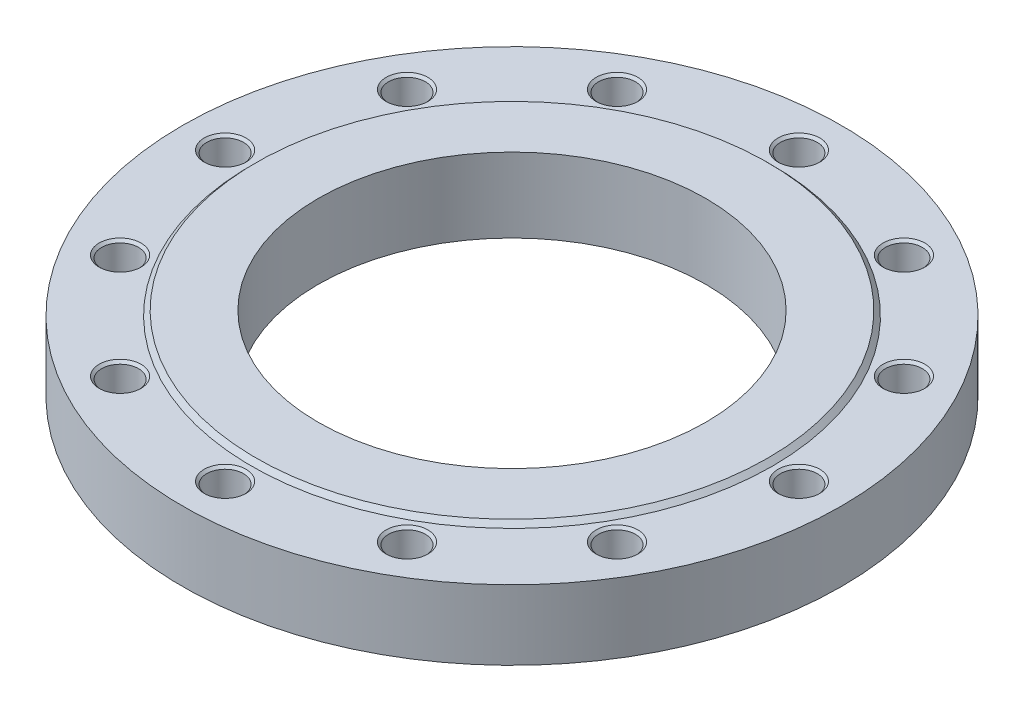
ISO-10303-21;
HEADER;
FILE_DESCRIPTION(('STEP AP214'),'2;1');
FILE_NAME('part.step','',(''),(''),'','','');
FILE_SCHEMA(('AUTOMOTIVE_DESIGN { 1 0 10303 214 1 1 1 1 }'));
ENDSEC;
DATA;
#1=APPLICATION_CONTEXT('core data for automotive mechanical design processes');
#2=APPLICATION_PROTOCOL_DEFINITION('international standard','automotive_design',2000,#1);
#3=PRODUCT_CONTEXT('',#1,'mechanical');
#4=PRODUCT('Part','Part','',(#3));
#5=PRODUCT_RELATED_PRODUCT_CATEGORY('part','',(#4));
#6=PRODUCT_DEFINITION_FORMATION('','',#4);
#7=PRODUCT_DEFINITION_CONTEXT('part definition',#1,'design');
#8=PRODUCT_DEFINITION('design','',#6,#7);
#9=PRODUCT_DEFINITION_SHAPE('','',#8);
#10=(LENGTH_UNIT() NAMED_UNIT(*) SI_UNIT(.MILLI.,.METRE.));
#11=(NAMED_UNIT(*) PLANE_ANGLE_UNIT() SI_UNIT($,.RADIAN.));
#12=(NAMED_UNIT(*) SI_UNIT($,.STERADIAN.) SOLID_ANGLE_UNIT());
#13=UNCERTAINTY_MEASURE_WITH_UNIT(LENGTH_MEASURE(1.E-05),#10,'distance_accuracy_value','');
#14=(GEOMETRIC_REPRESENTATION_CONTEXT(3) GLOBAL_UNCERTAINTY_ASSIGNED_CONTEXT((#13)) GLOBAL_UNIT_ASSIGNED_CONTEXT((#10,
#11,#12)) REPRESENTATION_CONTEXT('',''));
#15=CARTESIAN_POINT('',(0.,0.,0.));
#16=DIRECTION('',(0.,0.,1.));
#17=DIRECTION('',(1.,0.,0.));
#18=AXIS2_PLACEMENT_3D('',#15,#16,#17);
#19=CARTESIAN_POINT('',(0.,22.5,0.));
#20=DIRECTION('',(0.,-1.,0.));
#21=DIRECTION('',(1.,0.,0.));
#22=AXIS2_PLACEMENT_3D('',#19,#20,#21);
#23=CYLINDRICAL_SURFACE('',#22,212.5);
#24=CARTESIAN_POINT('',(0.,0.,0.));
#25=DIRECTION('',(0.,1.,0.));
#26=DIRECTION('',(1.,0.,0.));
#27=AXIS2_PLACEMENT_3D('',#24,#25,#26);
#28=CIRCLE('',#27,212.5);
#29=CARTESIAN_POINT('',(212.5,0.,0.));
#30=VERTEX_POINT('',#29);
#31=EDGE_CURVE('E9',#30,#30,#28,.T.);
#32=ORIENTED_EDGE('',*,*,#31,.T.);
#33=EDGE_LOOP('',(#32));
#34=FACE_BOUND('',#33,.T.);
#35=CARTESIAN_POINT('',(0.,45.,0.));
#36=DIRECTION('',(0.,1.,0.));
#37=DIRECTION('',(1.,0.,0.));
#38=AXIS2_PLACEMENT_3D('',#35,#36,#37);
#39=CIRCLE('',#38,212.5);
#40=CARTESIAN_POINT('',(212.5,45.,0.));
#41=VERTEX_POINT('',#40);
#42=EDGE_CURVE('E370',#41,#41,#39,.T.);
#43=ORIENTED_EDGE('',*,*,#42,.F.);
#44=EDGE_LOOP('',(#43));
#45=FACE_BOUND('',#44,.T.);
#46=ADVANCED_FACE('F15',(#34,#45),#23,.T.);
#47=CARTESIAN_POINT('',(168.75,0.,0.));
#48=DIRECTION('',(0.,-1.,0.));
#49=DIRECTION('',(-1.,0.,0.));
#50=AXIS2_PLACEMENT_3D('',#47,#48,#49);
#51=PLANE('',#50);
#52=CARTESIAN_POINT('',(0.,0.,0.));
#53=DIRECTION('',(0.,1.,0.));
#54=DIRECTION('',(1.,0.,0.));
#55=AXIS2_PLACEMENT_3D('',#52,#53,#54);
#56=CIRCLE('',#55,125.);
#57=CARTESIAN_POINT('',(125.,0.,0.));
#58=VERTEX_POINT('',#57);
#59=EDGE_CURVE('E24',#58,#58,#56,.T.);
#60=ORIENTED_EDGE('',*,*,#59,.T.);
#61=EDGE_LOOP('',(#60));
#62=FACE_BOUND('',#61,.T.);
#63=ORIENTED_EDGE('',*,*,#31,.F.);
#64=EDGE_LOOP('',(#63));
#65=FACE_BOUND('',#64,.T.);
#66=ADVANCED_FACE('F406',(#62,#65),#51,.T.);
#67=CARTESIAN_POINT('',(0.,24.,0.));
#68=DIRECTION('',(0.,-1.,0.));
#69=DIRECTION('',(1.,0.,0.));
#70=AXIS2_PLACEMENT_3D('',#67,#68,#69);
#71=CYLINDRICAL_SURFACE('',#70,125.);
#72=CARTESIAN_POINT('',(0.,48.,0.));
#73=DIRECTION('',(0.,1.,0.));
#74=DIRECTION('',(1.,0.,0.));
#75=AXIS2_PLACEMENT_3D('',#72,#73,#74);
#76=CIRCLE('',#75,125.);
#77=CARTESIAN_POINT('',(125.,48.,0.));
#78=VERTEX_POINT('',#77);
#79=EDGE_CURVE('E18',#78,#78,#76,.T.);
#80=ORIENTED_EDGE('',*,*,#79,.T.);
#81=EDGE_LOOP('',(#80));
#82=FACE_BOUND('',#81,.T.);
#83=ORIENTED_EDGE('',*,*,#59,.F.);
#84=EDGE_LOOP('',(#83));
#85=FACE_BOUND('',#84,.T.);
#86=ADVANCED_FACE('F393',(#82,#85),#71,.F.);
#87=CARTESIAN_POINT('',(145.,48.,0.));
#88=DIRECTION('',(0.,1.,0.));
#89=DIRECTION('',(1.,0.,0.));
#90=AXIS2_PLACEMENT_3D('',#87,#88,#89);
#91=PLANE('',#90);
#92=CARTESIAN_POINT('',(0.,48.,0.));
#93=DIRECTION('',(0.,1.,0.));
#94=DIRECTION('',(1.,0.,0.));
#95=AXIS2_PLACEMENT_3D('',#92,#93,#94);
#96=CIRCLE('',#95,165.);
#97=CARTESIAN_POINT('',(165.,48.,0.));
#98=VERTEX_POINT('',#97);
#99=EDGE_CURVE('E372',#98,#98,#96,.T.);
#100=ORIENTED_EDGE('',*,*,#99,.T.);
#101=EDGE_LOOP('',(#100));
#102=FACE_BOUND('',#101,.T.);
#103=ORIENTED_EDGE('',*,*,#79,.F.);
#104=EDGE_LOOP('',(#103));
#105=FACE_BOUND('',#104,.T.);
#106=ADVANCED_FACE('F396',(#102,#105),#91,.T.);
#107=CARTESIAN_POINT('',(0.,46.5,0.));
#108=DIRECTION('',(0.,-1.,0.));
#109=DIRECTION('',(1.,0.,0.));
#110=AXIS2_PLACEMENT_3D('',#107,#108,#109);
#111=CONICAL_SURFACE('',#110,166.5,0.785398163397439);
#112=CARTESIAN_POINT('',(0.,45.,0.));
#113=DIRECTION('',(0.,1.,0.));
#114=DIRECTION('',(1.,0.,0.));
#115=AXIS2_PLACEMENT_3D('',#112,#113,#114);
#116=CIRCLE('',#115,168.);
#117=CARTESIAN_POINT('',(168.,45.,0.));
#118=VERTEX_POINT('',#117);
#119=EDGE_CURVE('E196',#118,#118,#116,.T.);
#120=ORIENTED_EDGE('',*,*,#119,.T.);
#121=EDGE_LOOP('',(#120));
#122=FACE_BOUND('',#121,.T.);
#123=ORIENTED_EDGE('',*,*,#99,.F.);
#124=EDGE_LOOP('',(#123));
#125=FACE_BOUND('',#124,.T.);
#126=ADVANCED_FACE('F398',(#122,#125),#111,.T.);
#127=CARTESIAN_POINT('',(190.25,45.,0.));
#128=DIRECTION('',(0.,1.,0.));
#129=DIRECTION('',(1.,0.,0.));
#130=AXIS2_PLACEMENT_3D('',#127,#128,#129);
#131=PLANE('',#130);
#132=ORIENTED_EDGE('',*,*,#42,.T.);
#133=EDGE_LOOP('',(#132));
#134=FACE_BOUND('',#133,.T.);
#135=ORIENTED_EDGE('',*,*,#119,.F.);
#136=EDGE_LOOP('',(#135));
#137=FACE_BOUND('',#136,.T.);
#138=CARTESIAN_POINT('',(185.,45.,0.));
#139=DIRECTION('',(0.,-1.,0.));
#140=DIRECTION('',(1.,0.,0.));
#141=AXIS2_PLACEMENT_3D('',#138,#139,#140);
#142=CIRCLE('',#141,13.5);
#143=CARTESIAN_POINT('',(198.5,45.,0.));
#144=VERTEX_POINT('',#143);
#145=EDGE_CURVE('E381',#144,#144,#142,.T.);
#146=ORIENTED_EDGE('',*,*,#145,.T.);
#147=EDGE_LOOP('',(#146));
#148=FACE_BOUND('',#147,.T.);
#149=CARTESIAN_POINT('',(160.214699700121,45.,-92.5));
#150=DIRECTION('',(0.,-1.,0.));
#151=DIRECTION('',(0.866025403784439,0.,-0.5));
#152=AXIS2_PLACEMENT_3D('',#149,#150,#151);
#153=CIRCLE('',#152,13.5);
#154=CARTESIAN_POINT('',(171.906042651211,45.,-99.25));
#155=VERTEX_POINT('',#154);
#156=EDGE_CURVE('E349',#155,#155,#153,.T.);
#157=ORIENTED_EDGE('',*,*,#156,.T.);
#158=EDGE_LOOP('',(#157));
#159=FACE_BOUND('',#158,.T.);
#160=CARTESIAN_POINT('',(92.5,45.,-160.214699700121));
#161=DIRECTION('',(0.,-1.,0.));
#162=DIRECTION('',(0.5,0.,-0.866025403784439));
#163=AXIS2_PLACEMENT_3D('',#160,#161,#162);
#164=CIRCLE('',#163,13.5);
#165=CARTESIAN_POINT('',(99.25,45.,-171.906042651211));
#166=VERTEX_POINT('',#165);
#167=EDGE_CURVE('E307',#166,#166,#164,.T.);
#168=ORIENTED_EDGE('',*,*,#167,.T.);
#169=EDGE_LOOP('',(#168));
#170=FACE_BOUND('',#169,.T.);
#171=CARTESIAN_POINT('',(0.,45.,-185.));
#172=DIRECTION('',(0.,-1.,0.));
#173=DIRECTION('',(0.,0.,-1.));
#174=AXIS2_PLACEMENT_3D('',#171,#172,#173);
#175=CIRCLE('',#174,13.5);
#176=CARTESIAN_POINT('',(0.,45.,-198.5));
#177=VERTEX_POINT('',#176);
#178=EDGE_CURVE('E364',#177,#177,#175,.T.);
#179=ORIENTED_EDGE('',*,*,#178,.T.);
#180=EDGE_LOOP('',(#179));
#181=FACE_BOUND('',#180,.T.);
#182=CARTESIAN_POINT('',(-92.5,45.,-160.214699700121));
#183=DIRECTION('',(0.,-1.,0.));
#184=DIRECTION('',(-0.5,0.,-0.866025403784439));
#185=AXIS2_PLACEMENT_3D('',#182,#183,#184);
#186=CIRCLE('',#185,13.5);
#187=CARTESIAN_POINT('',(-99.25,45.,-171.906042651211));
#188=VERTEX_POINT('',#187);
#189=EDGE_CURVE('E344',#188,#188,#186,.T.);
#190=ORIENTED_EDGE('',*,*,#189,.T.);
#191=EDGE_LOOP('',(#190));
#192=FACE_BOUND('',#191,.T.);
#193=CARTESIAN_POINT('',(-160.214699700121,45.,-92.5));
#194=DIRECTION('',(0.,-1.,0.));
#195=DIRECTION('',(-0.866025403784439,0.,-0.5));
#196=AXIS2_PLACEMENT_3D('',#193,#194,#195);
#197=CIRCLE('',#196,13.5);
#198=CARTESIAN_POINT('',(-171.906042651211,45.,-99.25));
#199=VERTEX_POINT('',#198);
#200=EDGE_CURVE('E324',#199,#199,#197,.T.);
#201=ORIENTED_EDGE('',*,*,#200,.T.);
#202=EDGE_LOOP('',(#201));
#203=FACE_BOUND('',#202,.T.);
#204=CARTESIAN_POINT('',(-185.,45.,0.));
#205=DIRECTION('',(0.,-1.,0.));
#206=DIRECTION('',(-1.,0.,0.));
#207=AXIS2_PLACEMENT_3D('',#204,#205,#206);
#208=CIRCLE('',#207,13.5);
#209=CARTESIAN_POINT('',(-198.5,45.,0.));
#210=VERTEX_POINT('',#209);
#211=EDGE_CURVE('E312',#210,#210,#208,.T.);
#212=ORIENTED_EDGE('',*,*,#211,.T.);
#213=EDGE_LOOP('',(#212));
#214=FACE_BOUND('',#213,.T.);
#215=CARTESIAN_POINT('',(-160.214699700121,45.,92.5));
#216=DIRECTION('',(0.,-1.,0.));
#217=DIRECTION('',(-0.866025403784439,0.,0.5));
#218=AXIS2_PLACEMENT_3D('',#215,#216,#217);
#219=CIRCLE('',#218,13.5);
#220=CARTESIAN_POINT('',(-171.906042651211,45.,99.25));
#221=VERTEX_POINT('',#220);
#222=EDGE_CURVE('E288',#221,#221,#219,.T.);
#223=ORIENTED_EDGE('',*,*,#222,.T.);
#224=EDGE_LOOP('',(#223));
#225=FACE_BOUND('',#224,.T.);
#226=CARTESIAN_POINT('',(-92.5,45.,160.214699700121));
#227=DIRECTION('',(0.,-1.,0.));
#228=DIRECTION('',(-0.5,0.,0.866025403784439));
#229=AXIS2_PLACEMENT_3D('',#226,#227,#228);
#230=CIRCLE('',#229,13.5);
#231=CARTESIAN_POINT('',(-99.25,45.,171.906042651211));
#232=VERTEX_POINT('',#231);
#233=EDGE_CURVE('E1152',#232,#232,#230,.T.);
#234=ORIENTED_EDGE('',*,*,#233,.T.);
#235=EDGE_LOOP('',(#234));
#236=FACE_BOUND('',#235,.T.);
#237=CARTESIAN_POINT('',(0.,45.,185.));
#238=DIRECTION('',(0.,-1.,0.));
#239=DIRECTION('',(0.,0.,1.));
#240=AXIS2_PLACEMENT_3D('',#237,#238,#239);
#241=CIRCLE('',#240,13.5);
#242=CARTESIAN_POINT('',(0.,45.,198.5));
#243=VERTEX_POINT('',#242);
#244=EDGE_CURVE('E1123',#243,#243,#241,.T.);
#245=ORIENTED_EDGE('',*,*,#244,.T.);
#246=EDGE_LOOP('',(#245));
#247=FACE_BOUND('',#246,.T.);
#248=CARTESIAN_POINT('',(92.5,45.,160.214699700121));
#249=DIRECTION('',(0.,-1.,0.));
#250=DIRECTION('',(0.5,0.,0.866025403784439));
#251=AXIS2_PLACEMENT_3D('',#248,#249,#250);
#252=CIRCLE('',#251,13.5);
#253=CARTESIAN_POINT('',(99.25,45.,171.906042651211));
#254=VERTEX_POINT('',#253);
#255=EDGE_CURVE('E1135',#254,#254,#252,.T.);
#256=ORIENTED_EDGE('',*,*,#255,.T.);
#257=EDGE_LOOP('',(#256));
#258=FACE_BOUND('',#257,.T.);
#259=CARTESIAN_POINT('',(160.214699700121,45.,92.5));
#260=DIRECTION('',(0.,-1.,0.));
#261=DIRECTION('',(0.866025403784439,0.,0.5));
#262=AXIS2_PLACEMENT_3D('',#259,#260,#261);
#263=CIRCLE('',#262,13.5);
#264=CARTESIAN_POINT('',(171.906042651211,45.,99.25));
#265=VERTEX_POINT('',#264);
#266=EDGE_CURVE('E1106',#265,#265,#263,.T.);
#267=ORIENTED_EDGE('',*,*,#266,.T.);
#268=EDGE_LOOP('',(#267));
#269=FACE_BOUND('',#268,.T.);
#270=ADVANCED_FACE('F289',(#134,#137,#148,#159,#170,#181,#192,#203,#214,#225,#236,#247,#258,
#269),#131,.T.);
#271=CARTESIAN_POINT('',(185.,5.57162193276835,0.));
#272=DIRECTION('',(0.,1.,0.));
#273=DIRECTION('',(1.,0.,0.));
#274=AXIS2_PLACEMENT_3D('',#271,#272,#273);
#275=CONICAL_SURFACE('',#274,5.938125,1.0471975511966);
#276=CARTESIAN_POINT('',(185.,9.,0.));
#277=DIRECTION('',(0.,-1.,0.));
#278=DIRECTION('',(1.,0.,0.));
#279=AXIS2_PLACEMENT_3D('',#276,#277,#278);
#280=CIRCLE('',#279,11.87625);
#281=CARTESIAN_POINT('',(196.87625,9.,0.));
#282=VERTEX_POINT('',#281);
#283=EDGE_CURVE('E201',#282,#282,#280,.T.);
#284=ORIENTED_EDGE('',*,*,#283,.F.);
#285=EDGE_LOOP('',(#284));
#286=FACE_BOUND('',#285,.T.);
#287=CARTESIAN_POINT('',(185.,2.1432438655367,0.));
#288=VERTEX_POINT('',#287);
#289=VERTEX_LOOP('',#288);
#290=FACE_BOUND('',#289,.T.);
#291=ADVANCED_FACE('F420',(#286,#290),#275,.F.);
#292=CARTESIAN_POINT('',(185.,13.688125,0.));
#293=DIRECTION('',(0.,1.,0.));
#294=DIRECTION('',(1.,0.,0.));
#295=AXIS2_PLACEMENT_3D('',#292,#293,#294);
#296=CYLINDRICAL_SURFACE('',#295,11.87625);
#297=CARTESIAN_POINT('',(185.,18.37625,0.));
#298=DIRECTION('',(0.,-1.,0.));
#299=DIRECTION('',(1.,0.,0.));
#300=AXIS2_PLACEMENT_3D('',#297,#298,#299);
#301=CIRCLE('',#300,11.87625);
#302=CARTESIAN_POINT('',(196.87625,18.37625,0.));
#303=VERTEX_POINT('',#302);
#304=EDGE_CURVE('E386',#303,#303,#301,.T.);
#305=ORIENTED_EDGE('',*,*,#304,.F.);
#306=EDGE_LOOP('',(#305));
#307=FACE_BOUND('',#306,.T.);
#308=ORIENTED_EDGE('',*,*,#283,.T.);
#309=EDGE_LOOP('',(#308));
#310=FACE_BOUND('',#309,.T.);
#311=ADVANCED_FACE('F587',(#307,#310),#296,.F.);
#312=CARTESIAN_POINT('',(185.,19.188125,0.));
#313=DIRECTION('',(0.,1.,0.));
#314=DIRECTION('',(1.,0.,0.));
#315=AXIS2_PLACEMENT_3D('',#312,#313,#314);
#316=CONICAL_SURFACE('',#315,12.688125,0.785398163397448);
#317=CARTESIAN_POINT('',(185.,20.,0.));
#318=DIRECTION('',(0.,-1.,0.));
#319=DIRECTION('',(1.,0.,0.));
#320=AXIS2_PLACEMENT_3D('',#317,#318,#319);
#321=CIRCLE('',#320,13.5);
#322=CARTESIAN_POINT('',(198.5,20.,0.));
#323=VERTEX_POINT('',#322);
#324=EDGE_CURVE('E385',#323,#323,#321,.T.);
#325=ORIENTED_EDGE('',*,*,#324,.F.);
#326=EDGE_LOOP('',(#325));
#327=FACE_BOUND('',#326,.T.);
#328=ORIENTED_EDGE('',*,*,#304,.T.);
#329=EDGE_LOOP('',(#328));
#330=FACE_BOUND('',#329,.T.);
#331=ADVANCED_FACE('F583',(#327,#330),#316,.F.);
#332=CARTESIAN_POINT('',(197.688125,20.,0.));
#333=DIRECTION('',(0.,1.,0.));
#334=DIRECTION('',(-1.,0.,0.));
#335=AXIS2_PLACEMENT_3D('',#332,#333,#334);
#336=PLANE('',#335);
#337=CARTESIAN_POINT('',(185.,20.,0.));
#338=DIRECTION('',(0.,-1.,0.));
#339=DIRECTION('',(1.,0.,0.));
#340=AXIS2_PLACEMENT_3D('',#337,#338,#339);
#341=CIRCLE('',#340,11.87625);
#342=CARTESIAN_POINT('',(196.87625,20.,0.));
#343=VERTEX_POINT('',#342);
#344=EDGE_CURVE('E383',#343,#343,#341,.T.);
#345=ORIENTED_EDGE('',*,*,#344,.F.);
#346=EDGE_LOOP('',(#345));
#347=FACE_BOUND('',#346,.T.);
#348=ORIENTED_EDGE('',*,*,#324,.T.);
#349=EDGE_LOOP('',(#348));
#350=FACE_BOUND('',#349,.T.);
#351=ADVANCED_FACE('F579',(#347,#350),#336,.F.);
#352=CARTESIAN_POINT('',(185.,31.688125,0.));
#353=DIRECTION('',(0.,1.,0.));
#354=DIRECTION('',(1.,0.,0.));
#355=AXIS2_PLACEMENT_3D('',#352,#353,#354);
#356=CYLINDRICAL_SURFACE('',#355,11.87625);
#357=CARTESIAN_POINT('',(185.,43.37625,0.));
#358=DIRECTION('',(0.,-1.,0.));
#359=DIRECTION('',(1.,0.,0.));
#360=AXIS2_PLACEMENT_3D('',#357,#358,#359);
#361=CIRCLE('',#360,11.87625);
#362=CARTESIAN_POINT('',(196.87625,43.37625,0.));
#363=VERTEX_POINT('',#362);
#364=EDGE_CURVE('E379',#363,#363,#361,.T.);
#365=ORIENTED_EDGE('',*,*,#364,.F.);
#366=EDGE_LOOP('',(#365));
#367=FACE_BOUND('',#366,.T.);
#368=ORIENTED_EDGE('',*,*,#344,.T.);
#369=EDGE_LOOP('',(#368));
#370=FACE_BOUND('',#369,.T.);
#371=ADVANCED_FACE('F575',(#367,#370),#356,.F.);
#372=CARTESIAN_POINT('',(185.,44.188125,0.));
#373=DIRECTION('',(0.,1.,0.));
#374=DIRECTION('',(1.,0.,0.));
#375=AXIS2_PLACEMENT_3D('',#372,#373,#374);
#376=CONICAL_SURFACE('',#375,12.688125,0.785398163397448);
#377=ORIENTED_EDGE('',*,*,#145,.F.);
#378=EDGE_LOOP('',(#377));
#379=FACE_BOUND('',#378,.T.);
#380=ORIENTED_EDGE('',*,*,#364,.T.);
#381=EDGE_LOOP('',(#380));
#382=FACE_BOUND('',#381,.T.);
#383=ADVANCED_FACE('F571',(#379,#382),#376,.F.);
#384=CARTESIAN_POINT('',(160.214699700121,5.57162193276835,-92.5));
#385=DIRECTION('',(0.,1.,0.));
#386=DIRECTION('',(0.866025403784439,0.,-0.5));
#387=AXIS2_PLACEMENT_3D('',#384,#385,#386);
#388=CONICAL_SURFACE('',#387,5.938125,1.0471975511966);
#389=CARTESIAN_POINT('',(160.214699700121,9.,-92.5));
#390=DIRECTION('',(0.,-1.,0.));
#391=DIRECTION('',(0.866025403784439,0.,-0.5));
#392=AXIS2_PLACEMENT_3D('',#389,#390,#391);
#393=CIRCLE('',#392,11.87625);
#394=CARTESIAN_POINT('',(170.499833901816,9.,-98.438125));
#395=VERTEX_POINT('',#394);
#396=EDGE_CURVE('E354',#395,#395,#393,.T.);
#397=ORIENTED_EDGE('',*,*,#396,.F.);
#398=EDGE_LOOP('',(#397));
#399=FACE_BOUND('',#398,.T.);
#400=CARTESIAN_POINT('',(160.214699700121,2.1432438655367,-92.5));
#401=VERTEX_POINT('',#400);
#402=VERTEX_LOOP('',#401);
#403=FACE_BOUND('',#402,.T.);
#404=ADVANCED_FACE('F574',(#399,#403),#388,.F.);
#405=CARTESIAN_POINT('',(160.214699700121,13.688125,-92.5));
#406=DIRECTION('',(0.,1.,0.));
#407=DIRECTION('',(0.866025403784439,0.,-0.5));
#408=AXIS2_PLACEMENT_3D('',#405,#406,#407);
#409=CYLINDRICAL_SURFACE('',#408,11.87625);
#410=CARTESIAN_POINT('',(160.214699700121,18.37625,-92.5));
#411=DIRECTION('',(0.,-1.,0.));
#412=DIRECTION('',(0.866025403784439,0.,-0.5));
#413=AXIS2_PLACEMENT_3D('',#410,#411,#412);
#414=CIRCLE('',#413,11.87625);
#415=CARTESIAN_POINT('',(170.499833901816,18.37625,-98.438125));
#416=VERTEX_POINT('',#415);
#417=EDGE_CURVE('E352',#416,#416,#414,.T.);
#418=ORIENTED_EDGE('',*,*,#417,.F.);
#419=EDGE_LOOP('',(#418));
#420=FACE_BOUND('',#419,.T.);
#421=ORIENTED_EDGE('',*,*,#396,.T.);
#422=EDGE_LOOP('',(#421));
#423=FACE_BOUND('',#422,.T.);
#424=ADVANCED_FACE('F527',(#420,#423),#409,.F.);
#425=CARTESIAN_POINT('',(160.214699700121,19.188125,-92.5));
#426=DIRECTION('',(0.,1.,0.));
#427=DIRECTION('',(0.866025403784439,0.,-0.5));
#428=AXIS2_PLACEMENT_3D('',#425,#426,#427);
#429=CONICAL_SURFACE('',#428,12.688125,0.785398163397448);
#430=CARTESIAN_POINT('',(160.214699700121,20.,-92.5));
#431=DIRECTION('',(0.,-1.,0.));
#432=DIRECTION('',(0.866025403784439,0.,-0.5));
#433=AXIS2_PLACEMENT_3D('',#430,#431,#432);
#434=CIRCLE('',#433,13.5);
#435=CARTESIAN_POINT('',(171.906042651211,20.,-99.25));
#436=VERTEX_POINT('',#435);
#437=EDGE_CURVE('E348',#436,#436,#434,.T.);
#438=ORIENTED_EDGE('',*,*,#437,.F.);
#439=EDGE_LOOP('',(#438));
#440=FACE_BOUND('',#439,.T.);
#441=ORIENTED_EDGE('',*,*,#417,.T.);
#442=EDGE_LOOP('',(#441));
#443=FACE_BOUND('',#442,.T.);
#444=ADVANCED_FACE('F523',(#440,#443),#429,.F.);
#445=CARTESIAN_POINT('',(171.202938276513,20.,-98.8440625));
#446=DIRECTION('',(0.,1.,0.));
#447=DIRECTION('',(-0.866025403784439,0.,0.5));
#448=AXIS2_PLACEMENT_3D('',#445,#446,#447);
#449=PLANE('',#448);
#450=CARTESIAN_POINT('',(160.214699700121,20.,-92.5));
#451=DIRECTION('',(0.,-1.,0.));
#452=DIRECTION('',(0.866025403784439,0.,-0.5));
#453=AXIS2_PLACEMENT_3D('',#450,#451,#452);
#454=CIRCLE('',#453,11.87625);
#455=CARTESIAN_POINT('',(170.499833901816,20.,-98.438125));
#456=VERTEX_POINT('',#455);
#457=EDGE_CURVE('E345',#456,#456,#454,.T.);
#458=ORIENTED_EDGE('',*,*,#457,.F.);
#459=EDGE_LOOP('',(#458));
#460=FACE_BOUND('',#459,.T.);
#461=ORIENTED_EDGE('',*,*,#437,.T.);
#462=EDGE_LOOP('',(#461));
#463=FACE_BOUND('',#462,.T.);
#464=ADVANCED_FACE('F526',(#460,#463),#449,.F.);
#465=CARTESIAN_POINT('',(160.214699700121,31.688125,-92.5));
#466=DIRECTION('',(0.,1.,0.));
#467=DIRECTION('',(0.866025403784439,0.,-0.5));
#468=AXIS2_PLACEMENT_3D('',#465,#466,#467);
#469=CYLINDRICAL_SURFACE('',#468,11.87625);
#470=CARTESIAN_POINT('',(160.214699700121,43.37625,-92.5));
#471=DIRECTION('',(0.,-1.,0.));
#472=DIRECTION('',(0.866025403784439,0.,-0.5));
#473=AXIS2_PLACEMENT_3D('',#470,#471,#472);
#474=CIRCLE('',#473,11.87625);
#475=CARTESIAN_POINT('',(170.499833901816,43.37625,-98.438125));
#476=VERTEX_POINT('',#475);
#477=EDGE_CURVE('E375',#476,#476,#474,.T.);
#478=ORIENTED_EDGE('',*,*,#477,.F.);
#479=EDGE_LOOP('',(#478));
#480=FACE_BOUND('',#479,.T.);
#481=ORIENTED_EDGE('',*,*,#457,.T.);
#482=EDGE_LOOP('',(#481));
#483=FACE_BOUND('',#482,.T.);
#484=ADVANCED_FACE('F564',(#480,#483),#469,.F.);
#485=CARTESIAN_POINT('',(160.214699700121,44.188125,-92.5));
#486=DIRECTION('',(0.,1.,0.));
#487=DIRECTION('',(0.866025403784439,0.,-0.5));
#488=AXIS2_PLACEMENT_3D('',#485,#486,#487);
#489=CONICAL_SURFACE('',#488,12.688125,0.785398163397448);
#490=ORIENTED_EDGE('',*,*,#156,.F.);
#491=EDGE_LOOP('',(#490));
#492=FACE_BOUND('',#491,.T.);
#493=ORIENTED_EDGE('',*,*,#477,.T.);
#494=EDGE_LOOP('',(#493));
#495=FACE_BOUND('',#494,.T.);
#496=ADVANCED_FACE('F491',(#492,#495),#489,.F.);
#497=CARTESIAN_POINT('',(92.5,5.57162193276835,-160.214699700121));
#498=DIRECTION('',(0.,1.,0.));
#499=DIRECTION('',(0.5,0.,-0.866025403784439));
#500=AXIS2_PLACEMENT_3D('',#497,#498,#499);
#501=CONICAL_SURFACE('',#500,5.938125,1.0471975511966);
#502=CARTESIAN_POINT('',(92.5,9.,-160.214699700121));
#503=DIRECTION('',(0.,-1.,0.));
#504=DIRECTION('',(0.5,0.,-0.866025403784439));
#505=AXIS2_PLACEMENT_3D('',#502,#503,#504);
#506=CIRCLE('',#505,11.87625);
#507=CARTESIAN_POINT('',(98.438125,9.,-170.499833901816));
#508=VERTEX_POINT('',#507);
#509=EDGE_CURVE('E336',#508,#508,#506,.T.);
#510=ORIENTED_EDGE('',*,*,#509,.F.);
#511=EDGE_LOOP('',(#510));
#512=FACE_BOUND('',#511,.T.);
#513=CARTESIAN_POINT('',(92.5,2.1432438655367,-160.214699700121));
#514=VERTEX_POINT('',#513);
#515=VERTEX_LOOP('',#514);
#516=FACE_BOUND('',#515,.T.);
#517=ADVANCED_FACE('F487',(#512,#516),#501,.F.);
#518=CARTESIAN_POINT('',(92.5,13.688125,-160.214699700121));
#519=DIRECTION('',(0.,1.,0.));
#520=DIRECTION('',(0.5,0.,-0.866025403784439));
#521=AXIS2_PLACEMENT_3D('',#518,#519,#520);
#522=CYLINDRICAL_SURFACE('',#521,11.87625);
#523=CARTESIAN_POINT('',(92.5,18.37625,-160.214699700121));
#524=DIRECTION('',(0.,-1.,0.));
#525=DIRECTION('',(0.5,0.,-0.866025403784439));
#526=AXIS2_PLACEMENT_3D('',#523,#524,#525);
#527=CIRCLE('',#526,11.87625);
#528=CARTESIAN_POINT('',(98.438125,18.37625,-170.499833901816));
#529=VERTEX_POINT('',#528);
#530=EDGE_CURVE('E334',#529,#529,#527,.T.);
#531=ORIENTED_EDGE('',*,*,#530,.F.);
#532=EDGE_LOOP('',(#531));
#533=FACE_BOUND('',#532,.T.);
#534=ORIENTED_EDGE('',*,*,#509,.T.);
#535=EDGE_LOOP('',(#534));
#536=FACE_BOUND('',#535,.T.);
#537=ADVANCED_FACE('F490',(#533,#536),#522,.F.);
#538=CARTESIAN_POINT('',(92.5,19.188125,-160.214699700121));
#539=DIRECTION('',(0.,1.,0.));
#540=DIRECTION('',(0.5,0.,-0.866025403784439));
#541=AXIS2_PLACEMENT_3D('',#538,#539,#540);
#542=CONICAL_SURFACE('',#541,12.688125,0.785398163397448);
#543=CARTESIAN_POINT('',(92.5,20.,-160.214699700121));
#544=DIRECTION('',(0.,-1.,0.));
#545=DIRECTION('',(0.5,0.,-0.866025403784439));
#546=AXIS2_PLACEMENT_3D('',#543,#544,#545);
#547=CIRCLE('',#546,13.5);
#548=CARTESIAN_POINT('',(99.25,20.,-171.906042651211));
#549=VERTEX_POINT('',#548);
#550=EDGE_CURVE('E337',#549,#549,#547,.T.);
#551=ORIENTED_EDGE('',*,*,#550,.F.);
#552=EDGE_LOOP('',(#551));
#553=FACE_BOUND('',#552,.T.);
#554=ORIENTED_EDGE('',*,*,#530,.T.);
#555=EDGE_LOOP('',(#554));
#556=FACE_BOUND('',#555,.T.);
#557=ADVANCED_FACE('F557',(#553,#556),#542,.F.);
#558=CARTESIAN_POINT('',(98.8440625,20.,-171.202938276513));
#559=DIRECTION('',(0.,1.,0.));
#560=DIRECTION('',(-0.5,0.,0.866025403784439));
#561=AXIS2_PLACEMENT_3D('',#558,#559,#560);
#562=PLANE('',#561);
#563=CARTESIAN_POINT('',(92.5,20.,-160.214699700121));
#564=DIRECTION('',(0.,-1.,0.));
#565=DIRECTION('',(0.5,0.,-0.866025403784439));
#566=AXIS2_PLACEMENT_3D('',#563,#564,#565);
#567=CIRCLE('',#566,11.87625);
#568=CARTESIAN_POINT('',(98.438125,20.,-170.499833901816));
#569=VERTEX_POINT('',#568);
#570=EDGE_CURVE('E309',#569,#569,#567,.T.);
#571=ORIENTED_EDGE('',*,*,#570,.F.);
#572=EDGE_LOOP('',(#571));
#573=FACE_BOUND('',#572,.T.);
#574=ORIENTED_EDGE('',*,*,#550,.T.);
#575=EDGE_LOOP('',(#574));
#576=FACE_BOUND('',#575,.T.);
#577=ADVANCED_FACE('F555',(#573,#576),#562,.F.);
#578=CARTESIAN_POINT('',(92.5,31.688125,-160.214699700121));
#579=DIRECTION('',(0.,1.,0.));
#580=DIRECTION('',(0.5,0.,-0.866025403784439));
#581=AXIS2_PLACEMENT_3D('',#578,#579,#580);
#582=CYLINDRICAL_SURFACE('',#581,11.87625);
#583=CARTESIAN_POINT('',(92.5,43.37625,-160.214699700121));
#584=DIRECTION('',(0.,-1.,0.));
#585=DIRECTION('',(0.5,0.,-0.866025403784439));
#586=AXIS2_PLACEMENT_3D('',#583,#584,#585);
#587=CIRCLE('',#586,11.87625);
#588=CARTESIAN_POINT('',(98.438125,43.37625,-170.499833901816));
#589=VERTEX_POINT('',#588);
#590=EDGE_CURVE('E310',#589,#589,#587,.T.);
#591=ORIENTED_EDGE('',*,*,#590,.F.);
#592=EDGE_LOOP('',(#591));
#593=FACE_BOUND('',#592,.T.);
#594=ORIENTED_EDGE('',*,*,#570,.T.);
#595=EDGE_LOOP('',(#594));
#596=FACE_BOUND('',#595,.T.);
#597=ADVANCED_FACE('F551',(#593,#596),#582,.F.);
#598=CARTESIAN_POINT('',(92.5,44.188125,-160.214699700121));
#599=DIRECTION('',(0.,1.,0.));
#600=DIRECTION('',(0.5,0.,-0.866025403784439));
#601=AXIS2_PLACEMENT_3D('',#598,#599,#600);
#602=CONICAL_SURFACE('',#601,12.688125,0.785398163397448);
#603=ORIENTED_EDGE('',*,*,#167,.F.);
#604=EDGE_LOOP('',(#603));
#605=FACE_BOUND('',#604,.T.);
#606=ORIENTED_EDGE('',*,*,#590,.T.);
#607=EDGE_LOOP('',(#606));
#608=FACE_BOUND('',#607,.T.);
#609=ADVANCED_FACE('F548',(#605,#608),#602,.F.);
#610=CARTESIAN_POINT('',(0.,5.57162193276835,-185.));
#611=DIRECTION('',(0.,1.,0.));
#612=DIRECTION('',(0.,0.,-1.));
#613=AXIS2_PLACEMENT_3D('',#610,#611,#612);
#614=CONICAL_SURFACE('',#613,5.938125,1.0471975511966);
#615=CARTESIAN_POINT('',(0.,9.,-185.));
#616=DIRECTION('',(0.,-1.,0.));
#617=DIRECTION('',(0.,0.,-1.));
#618=AXIS2_PLACEMENT_3D('',#615,#616,#617);
#619=CIRCLE('',#618,11.87625);
#620=CARTESIAN_POINT('',(0.,9.,-196.87625));
#621=VERTEX_POINT('',#620);
#622=EDGE_CURVE('E325',#621,#621,#619,.T.);
#623=ORIENTED_EDGE('',*,*,#622,.F.);
#624=EDGE_LOOP('',(#623));
#625=FACE_BOUND('',#624,.T.);
#626=CARTESIAN_POINT('',(0.,2.1432438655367,-185.));
#627=VERTEX_POINT('',#626);
#628=VERTEX_LOOP('',#627);
#629=FACE_BOUND('',#628,.T.);
#630=ADVANCED_FACE('F480',(#625,#629),#614,.F.);
#631=CARTESIAN_POINT('',(0.,13.688125,-185.));
#632=DIRECTION('',(0.,1.,0.));
#633=DIRECTION('',(0.,0.,-1.));
#634=AXIS2_PLACEMENT_3D('',#631,#632,#633);
#635=CYLINDRICAL_SURFACE('',#634,11.87625);
#636=CARTESIAN_POINT('',(0.,18.37625,-185.));
#637=DIRECTION('',(0.,-1.,0.));
#638=DIRECTION('',(0.,0.,-1.));
#639=AXIS2_PLACEMENT_3D('',#636,#637,#638);
#640=CIRCLE('',#639,11.87625);
#641=CARTESIAN_POINT('',(0.,18.37625,-196.87625));
#642=VERTEX_POINT('',#641);
#643=EDGE_CURVE('E327',#642,#642,#640,.T.);
#644=ORIENTED_EDGE('',*,*,#643,.F.);
#645=EDGE_LOOP('',(#644));
#646=FACE_BOUND('',#645,.T.);
#647=ORIENTED_EDGE('',*,*,#622,.T.);
#648=EDGE_LOOP('',(#647));
#649=FACE_BOUND('',#648,.T.);
#650=ADVANCED_FACE('F513',(#646,#649),#635,.F.);
#651=CARTESIAN_POINT('',(0.,19.188125,-185.));
#652=DIRECTION('',(0.,1.,0.));
#653=DIRECTION('',(0.,0.,-1.));
#654=AXIS2_PLACEMENT_3D('',#651,#652,#653);
#655=CONICAL_SURFACE('',#654,12.688125,0.785398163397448);
#656=CARTESIAN_POINT('',(0.,20.,-185.));
#657=DIRECTION('',(0.,-1.,0.));
#658=DIRECTION('',(0.,0.,-1.));
#659=AXIS2_PLACEMENT_3D('',#656,#657,#658);
#660=CIRCLE('',#659,13.5);
#661=CARTESIAN_POINT('',(0.,20.,-198.5));
#662=VERTEX_POINT('',#661);
#663=EDGE_CURVE('E299',#662,#662,#660,.T.);
#664=ORIENTED_EDGE('',*,*,#663,.F.);
#665=EDGE_LOOP('',(#664));
#666=FACE_BOUND('',#665,.T.);
#667=ORIENTED_EDGE('',*,*,#643,.T.);
#668=EDGE_LOOP('',(#667));
#669=FACE_BOUND('',#668,.T.);
#670=ADVANCED_FACE('F509',(#666,#669),#655,.F.);
#671=CARTESIAN_POINT('',(0.,20.,-197.688125));
#672=DIRECTION('',(0.,1.,0.));
#673=DIRECTION('',(0.,0.,1.));
#674=AXIS2_PLACEMENT_3D('',#671,#672,#673);
#675=PLANE('',#674);
#676=CARTESIAN_POINT('',(0.,20.,-185.));
#677=DIRECTION('',(0.,-1.,0.));
#678=DIRECTION('',(0.,0.,-1.));
#679=AXIS2_PLACEMENT_3D('',#676,#677,#678);
#680=CIRCLE('',#679,11.87625);
#681=CARTESIAN_POINT('',(0.,20.,-196.87625));
#682=VERTEX_POINT('',#681);
#683=EDGE_CURVE('E365',#682,#682,#680,.T.);
#684=ORIENTED_EDGE('',*,*,#683,.F.);
#685=EDGE_LOOP('',(#684));
#686=FACE_BOUND('',#685,.T.);
#687=ORIENTED_EDGE('',*,*,#663,.T.);
#688=EDGE_LOOP('',(#687));
#689=FACE_BOUND('',#688,.T.);
#690=ADVANCED_FACE('F512',(#686,#689),#675,.F.);
#691=CARTESIAN_POINT('',(0.,31.688125,-185.));
#692=DIRECTION('',(0.,1.,0.));
#693=DIRECTION('',(0.,0.,-1.));
#694=AXIS2_PLACEMENT_3D('',#691,#692,#693);
#695=CYLINDRICAL_SURFACE('',#694,11.87625);
#696=CARTESIAN_POINT('',(0.,43.37625,-185.));
#697=DIRECTION('',(0.,-1.,0.));
#698=DIRECTION('',(0.,0.,-1.));
#699=AXIS2_PLACEMENT_3D('',#696,#697,#698);
#700=CIRCLE('',#699,11.87625);
#701=CARTESIAN_POINT('',(0.,43.37625,-196.87625));
#702=VERTEX_POINT('',#701);
#703=EDGE_CURVE('E362',#702,#702,#700,.T.);
#704=ORIENTED_EDGE('',*,*,#703,.F.);
#705=EDGE_LOOP('',(#704));
#706=FACE_BOUND('',#705,.T.);
#707=ORIENTED_EDGE('',*,*,#683,.T.);
#708=EDGE_LOOP('',(#707));
#709=FACE_BOUND('',#708,.T.);
#710=ADVANCED_FACE('F537',(#706,#709),#695,.F.);
#711=CARTESIAN_POINT('',(0.,44.188125,-185.));
#712=DIRECTION('',(0.,1.,0.));
#713=DIRECTION('',(0.,0.,-1.));
#714=AXIS2_PLACEMENT_3D('',#711,#712,#713);
#715=CONICAL_SURFACE('',#714,12.688125,0.785398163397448);
#716=ORIENTED_EDGE('',*,*,#178,.F.);
#717=EDGE_LOOP('',(#716));
#718=FACE_BOUND('',#717,.T.);
#719=ORIENTED_EDGE('',*,*,#703,.T.);
#720=EDGE_LOOP('',(#719));
#721=FACE_BOUND('',#720,.T.);
#722=ADVANCED_FACE('F533',(#718,#721),#715,.F.);
#723=CARTESIAN_POINT('',(-92.5,5.57162193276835,-160.214699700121));
#724=DIRECTION('',(0.,1.,0.));
#725=DIRECTION('',(-0.5,0.,-0.866025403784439));
#726=AXIS2_PLACEMENT_3D('',#723,#724,#725);
#727=CONICAL_SURFACE('',#726,5.938125,1.0471975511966);
#728=CARTESIAN_POINT('',(-92.5,9.,-160.214699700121));
#729=DIRECTION('',(0.,-1.,0.));
#730=DIRECTION('',(-0.5,0.,-0.866025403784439));
#731=AXIS2_PLACEMENT_3D('',#728,#729,#730);
#732=CIRCLE('',#731,11.87625);
#733=CARTESIAN_POINT('',(-98.438125,9.,-170.499833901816));
#734=VERTEX_POINT('',#733);
#735=EDGE_CURVE('E360',#734,#734,#732,.T.);
#736=ORIENTED_EDGE('',*,*,#735,.F.);
#737=EDGE_LOOP('',(#736));
#738=FACE_BOUND('',#737,.T.);
#739=CARTESIAN_POINT('',(-92.5,2.1432438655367,-160.214699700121));
#740=VERTEX_POINT('',#739);
#741=VERTEX_LOOP('',#740);
#742=FACE_BOUND('',#741,.T.);
#743=ADVANCED_FACE('F536',(#738,#742),#727,.F.);
#744=CARTESIAN_POINT('',(-92.5,13.688125,-160.214699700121));
#745=DIRECTION('',(0.,1.,0.));
#746=DIRECTION('',(-0.5,0.,-0.866025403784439));
#747=AXIS2_PLACEMENT_3D('',#744,#745,#746);
#748=CYLINDRICAL_SURFACE('',#747,11.87625);
#749=CARTESIAN_POINT('',(-92.5,18.37625,-160.214699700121));
#750=DIRECTION('',(0.,-1.,0.));
#751=DIRECTION('',(-0.5,0.,-0.866025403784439));
#752=AXIS2_PLACEMENT_3D('',#749,#750,#751);
#753=CIRCLE('',#752,11.87625);
#754=CARTESIAN_POINT('',(-98.438125,18.37625,-170.499833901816));
#755=VERTEX_POINT('',#754);
#756=EDGE_CURVE('E358',#755,#755,#753,.T.);
#757=ORIENTED_EDGE('',*,*,#756,.F.);
#758=EDGE_LOOP('',(#757));
#759=FACE_BOUND('',#758,.T.);
#760=ORIENTED_EDGE('',*,*,#735,.T.);
#761=EDGE_LOOP('',(#760));
#762=FACE_BOUND('',#761,.T.);
#763=ADVANCED_FACE('F531',(#759,#762),#748,.F.);
#764=CARTESIAN_POINT('',(-92.5,19.188125,-160.214699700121));
#765=DIRECTION('',(0.,1.,0.));
#766=DIRECTION('',(-0.5,0.,-0.866025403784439));
#767=AXIS2_PLACEMENT_3D('',#764,#765,#766);
#768=CONICAL_SURFACE('',#767,12.688125,0.785398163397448);
#769=CARTESIAN_POINT('',(-92.5,20.,-160.214699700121));
#770=DIRECTION('',(0.,-1.,0.));
#771=DIRECTION('',(-0.5,0.,-0.866025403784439));
#772=AXIS2_PLACEMENT_3D('',#769,#770,#771);
#773=CIRCLE('',#772,13.5);
#774=CARTESIAN_POINT('',(-99.25,20.,-171.906042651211));
#775=VERTEX_POINT('',#774);
#776=EDGE_CURVE('E355',#775,#775,#773,.T.);
#777=ORIENTED_EDGE('',*,*,#776,.F.);
#778=EDGE_LOOP('',(#777));
#779=FACE_BOUND('',#778,.T.);
#780=ORIENTED_EDGE('',*,*,#756,.T.);
#781=EDGE_LOOP('',(#780));
#782=FACE_BOUND('',#781,.T.);
#783=ADVANCED_FACE('F521',(#779,#782),#768,.F.);
#784=CARTESIAN_POINT('',(-98.8440625,20.,-171.202938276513));
#785=DIRECTION('',(0.,1.,0.));
#786=DIRECTION('',(0.5,0.,0.866025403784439));
#787=AXIS2_PLACEMENT_3D('',#784,#785,#786);
#788=PLANE('',#787);
#789=CARTESIAN_POINT('',(-92.5,20.,-160.214699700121));
#790=DIRECTION('',(0.,-1.,0.));
#791=DIRECTION('',(-0.5,0.,-0.866025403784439));
#792=AXIS2_PLACEMENT_3D('',#789,#790,#791);
#793=CIRCLE('',#792,11.87625);
#794=CARTESIAN_POINT('',(-98.438125,20.,-170.499833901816));
#795=VERTEX_POINT('',#794);
#796=EDGE_CURVE('E351',#795,#795,#793,.T.);
#797=ORIENTED_EDGE('',*,*,#796,.F.);
#798=EDGE_LOOP('',(#797));
#799=FACE_BOUND('',#798,.T.);
#800=ORIENTED_EDGE('',*,*,#776,.T.);
#801=EDGE_LOOP('',(#800));
#802=FACE_BOUND('',#801,.T.);
#803=ADVANCED_FACE('F517',(#799,#802),#788,.F.);
#804=CARTESIAN_POINT('',(-92.5,31.688125,-160.214699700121));
#805=DIRECTION('',(0.,1.,0.));
#806=DIRECTION('',(-0.5,0.,-0.866025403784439));
#807=AXIS2_PLACEMENT_3D('',#804,#805,#806);
#808=CYLINDRICAL_SURFACE('',#807,11.87625);
#809=CARTESIAN_POINT('',(-92.5,43.37625,-160.214699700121));
#810=DIRECTION('',(0.,-1.,0.));
#811=DIRECTION('',(-0.5,0.,-0.866025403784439));
#812=AXIS2_PLACEMENT_3D('',#809,#810,#811);
#813=CIRCLE('',#812,11.87625);
#814=CARTESIAN_POINT('',(-98.438125,43.37625,-170.499833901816));
#815=VERTEX_POINT('',#814);
#816=EDGE_CURVE('E342',#815,#815,#813,.T.);
#817=ORIENTED_EDGE('',*,*,#816,.F.);
#818=EDGE_LOOP('',(#817));
#819=FACE_BOUND('',#818,.T.);
#820=ORIENTED_EDGE('',*,*,#796,.T.);
#821=EDGE_LOOP('',(#820));
#822=FACE_BOUND('',#821,.T.);
#823=ADVANCED_FACE('F507',(#819,#822),#808,.F.);
#824=CARTESIAN_POINT('',(-92.5,44.188125,-160.214699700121));
#825=DIRECTION('',(0.,1.,0.));
#826=DIRECTION('',(-0.5,0.,-0.866025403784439));
#827=AXIS2_PLACEMENT_3D('',#824,#825,#826);
#828=CONICAL_SURFACE('',#827,12.688125,0.785398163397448);
#829=ORIENTED_EDGE('',*,*,#189,.F.);
#830=EDGE_LOOP('',(#829));
#831=FACE_BOUND('',#830,.T.);
#832=ORIENTED_EDGE('',*,*,#816,.T.);
#833=EDGE_LOOP('',(#832));
#834=FACE_BOUND('',#833,.T.);
#835=ADVANCED_FACE('F503',(#831,#834),#828,.F.);
#836=CARTESIAN_POINT('',(-160.214699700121,5.57162193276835,-92.5));
#837=DIRECTION('',(0.,1.,0.));
#838=DIRECTION('',(-0.866025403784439,0.,-0.5));
#839=AXIS2_PLACEMENT_3D('',#836,#837,#838);
#840=CONICAL_SURFACE('',#839,5.938125,1.0471975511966);
#841=CARTESIAN_POINT('',(-160.214699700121,9.,-92.5));
#842=DIRECTION('',(0.,-1.,0.));
#843=DIRECTION('',(-0.866025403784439,0.,-0.5));
#844=AXIS2_PLACEMENT_3D('',#841,#842,#843);
#845=CIRCLE('',#844,11.87625);
#846=CARTESIAN_POINT('',(-170.499833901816,9.,-98.438125));
#847=VERTEX_POINT('',#846);
#848=EDGE_CURVE('E339',#847,#847,#845,.T.);
#849=ORIENTED_EDGE('',*,*,#848,.F.);
#850=EDGE_LOOP('',(#849));
#851=FACE_BOUND('',#850,.T.);
#852=CARTESIAN_POINT('',(-160.214699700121,2.1432438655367,-92.5));
#853=VERTEX_POINT('',#852);
#854=VERTEX_LOOP('',#853);
#855=FACE_BOUND('',#854,.T.);
#856=ADVANCED_FACE('F498',(#851,#855),#840,.F.);
#857=CARTESIAN_POINT('',(-160.214699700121,13.688125,-92.5));
#858=DIRECTION('',(0.,1.,0.));
#859=DIRECTION('',(-0.866025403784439,0.,-0.5));
#860=AXIS2_PLACEMENT_3D('',#857,#858,#859);
#861=CYLINDRICAL_SURFACE('',#860,11.87625);
#862=CARTESIAN_POINT('',(-160.214699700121,18.37625,-92.5));
#863=DIRECTION('',(0.,-1.,0.));
#864=DIRECTION('',(-0.866025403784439,0.,-0.5));
#865=AXIS2_PLACEMENT_3D('',#862,#863,#864);
#866=CIRCLE('',#865,11.87625);
#867=CARTESIAN_POINT('',(-170.499833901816,18.37625,-98.438125));
#868=VERTEX_POINT('',#867);
#869=EDGE_CURVE('E333',#868,#868,#866,.T.);
#870=ORIENTED_EDGE('',*,*,#869,.F.);
#871=EDGE_LOOP('',(#870));
#872=FACE_BOUND('',#871,.T.);
#873=ORIENTED_EDGE('',*,*,#848,.T.);
#874=EDGE_LOOP('',(#873));
#875=FACE_BOUND('',#874,.T.);
#876=ADVANCED_FACE('F495',(#872,#875),#861,.F.);
#877=CARTESIAN_POINT('',(-160.214699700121,19.188125,-92.5));
#878=DIRECTION('',(0.,1.,0.));
#879=DIRECTION('',(-0.866025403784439,0.,-0.5));
#880=AXIS2_PLACEMENT_3D('',#877,#878,#879);
#881=CONICAL_SURFACE('',#880,12.688125,0.785398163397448);
#882=CARTESIAN_POINT('',(-160.214699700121,20.,-92.5));
#883=DIRECTION('',(0.,-1.,0.));
#884=DIRECTION('',(-0.866025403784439,0.,-0.5));
#885=AXIS2_PLACEMENT_3D('',#882,#883,#884);
#886=CIRCLE('',#885,13.5);
#887=CARTESIAN_POINT('',(-171.906042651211,20.,-99.25));
#888=VERTEX_POINT('',#887);
#889=EDGE_CURVE('E331',#888,#888,#886,.T.);
#890=ORIENTED_EDGE('',*,*,#889,.F.);
#891=EDGE_LOOP('',(#890));
#892=FACE_BOUND('',#891,.T.);
#893=ORIENTED_EDGE('',*,*,#869,.T.);
#894=EDGE_LOOP('',(#893));
#895=FACE_BOUND('',#894,.T.);
#896=ADVANCED_FACE('F485',(#892,#895),#881,.F.);
#897=CARTESIAN_POINT('',(-171.202938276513,20.,-98.8440625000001));
#898=DIRECTION('',(0.,1.,0.));
#899=DIRECTION('',(0.866025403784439,0.,0.5));
#900=AXIS2_PLACEMENT_3D('',#897,#898,#899);
#901=PLANE('',#900);
#902=CARTESIAN_POINT('',(-160.214699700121,20.,-92.5));
#903=DIRECTION('',(0.,-1.,0.));
#904=DIRECTION('',(-0.866025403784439,0.,-0.5));
#905=AXIS2_PLACEMENT_3D('',#902,#903,#904);
#906=CIRCLE('',#905,11.87625);
#907=CARTESIAN_POINT('',(-170.499833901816,20.,-98.438125));
#908=VERTEX_POINT('',#907);
#909=EDGE_CURVE('E329',#908,#908,#906,.T.);
#910=ORIENTED_EDGE('',*,*,#909,.F.);
#911=EDGE_LOOP('',(#910));
#912=FACE_BOUND('',#911,.T.);
#913=ORIENTED_EDGE('',*,*,#889,.T.);
#914=EDGE_LOOP('',(#913));
#915=FACE_BOUND('',#914,.T.);
#916=ADVANCED_FACE('F482',(#912,#915),#901,.F.);
#917=CARTESIAN_POINT('',(-160.214699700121,31.688125,-92.5));
#918=DIRECTION('',(0.,1.,0.));
#919=DIRECTION('',(-0.866025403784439,0.,-0.5));
#920=AXIS2_PLACEMENT_3D('',#917,#918,#919);
#921=CYLINDRICAL_SURFACE('',#920,11.87625);
#922=CARTESIAN_POINT('',(-160.214699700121,43.37625,-92.5));
#923=DIRECTION('',(0.,-1.,0.));
#924=DIRECTION('',(-0.866025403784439,0.,-0.5));
#925=AXIS2_PLACEMENT_3D('',#922,#923,#924);
#926=CIRCLE('',#925,11.87625);
#927=CARTESIAN_POINT('',(-170.499833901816,43.37625,-98.438125));
#928=VERTEX_POINT('',#927);
#929=EDGE_CURVE('E322',#928,#928,#926,.T.);
#930=ORIENTED_EDGE('',*,*,#929,.F.);
#931=EDGE_LOOP('',(#930));
#932=FACE_BOUND('',#931,.T.);
#933=ORIENTED_EDGE('',*,*,#909,.T.);
#934=EDGE_LOOP('',(#933));
#935=FACE_BOUND('',#934,.T.);
#936=ADVANCED_FACE('F476',(#932,#935),#921,.F.);
#937=CARTESIAN_POINT('',(-160.214699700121,44.188125,-92.5));
#938=DIRECTION('',(0.,1.,0.));
#939=DIRECTION('',(-0.866025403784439,0.,-0.5));
#940=AXIS2_PLACEMENT_3D('',#937,#938,#939);
#941=CONICAL_SURFACE('',#940,12.688125,0.785398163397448);
#942=ORIENTED_EDGE('',*,*,#200,.F.);
#943=EDGE_LOOP('',(#942));
#944=FACE_BOUND('',#943,.T.);
#945=ORIENTED_EDGE('',*,*,#929,.T.);
#946=EDGE_LOOP('',(#945));
#947=FACE_BOUND('',#946,.T.);
#948=ADVANCED_FACE('F471',(#944,#947),#941,.F.);
#949=CARTESIAN_POINT('',(-185.,5.57162193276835,0.));
#950=DIRECTION('',(0.,1.,0.));
#951=DIRECTION('',(-1.,0.,0.));
#952=AXIS2_PLACEMENT_3D('',#949,#950,#951);
#953=CONICAL_SURFACE('',#952,5.938125,1.0471975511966);
#954=CARTESIAN_POINT('',(-185.,9.,0.));
#955=DIRECTION('',(0.,-1.,0.));
#956=DIRECTION('',(-1.,0.,0.));
#957=AXIS2_PLACEMENT_3D('',#954,#955,#956);
#958=CIRCLE('',#957,11.87625);
#959=CARTESIAN_POINT('',(-196.87625,9.,0.));
#960=VERTEX_POINT('',#959);
#961=EDGE_CURVE('E320',#960,#960,#958,.T.);
#962=ORIENTED_EDGE('',*,*,#961,.F.);
#963=EDGE_LOOP('',(#962));
#964=FACE_BOUND('',#963,.T.);
#965=CARTESIAN_POINT('',(-185.,2.1432438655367,0.));
#966=VERTEX_POINT('',#965);
#967=VERTEX_LOOP('',#966);
#968=FACE_BOUND('',#967,.T.);
#969=ADVANCED_FACE('F465',(#964,#968),#953,.F.);
#970=CARTESIAN_POINT('',(-185.,13.688125,0.));
#971=DIRECTION('',(0.,1.,0.));
#972=DIRECTION('',(-1.,0.,0.));
#973=AXIS2_PLACEMENT_3D('',#970,#971,#972);
#974=CYLINDRICAL_SURFACE('',#973,11.87625);
#975=CARTESIAN_POINT('',(-185.,18.37625,0.));
#976=DIRECTION('',(0.,-1.,0.));
#977=DIRECTION('',(-1.,0.,0.));
#978=AXIS2_PLACEMENT_3D('',#975,#976,#977);
#979=CIRCLE('',#978,11.87625);
#980=CARTESIAN_POINT('',(-196.87625,18.37625,0.));
#981=VERTEX_POINT('',#980);
#982=EDGE_CURVE('E318',#981,#981,#979,.T.);
#983=ORIENTED_EDGE('',*,*,#982,.F.);
#984=EDGE_LOOP('',(#983));
#985=FACE_BOUND('',#984,.T.);
#986=ORIENTED_EDGE('',*,*,#961,.T.);
#987=EDGE_LOOP('',(#986));
#988=FACE_BOUND('',#987,.T.);
#989=ADVANCED_FACE('F459',(#985,#988),#974,.F.);
#990=CARTESIAN_POINT('',(-185.,19.188125,0.));
#991=DIRECTION('',(0.,1.,0.));
#992=DIRECTION('',(-1.,0.,0.));
#993=AXIS2_PLACEMENT_3D('',#990,#991,#992);
#994=CONICAL_SURFACE('',#993,12.688125,0.785398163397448);
#995=CARTESIAN_POINT('',(-185.,20.,0.));
#996=DIRECTION('',(0.,-1.,0.));
#997=DIRECTION('',(-1.,0.,0.));
#998=AXIS2_PLACEMENT_3D('',#995,#996,#997);
#999=CIRCLE('',#998,13.5);
#1000=CARTESIAN_POINT('',(-198.5,20.,0.));
#1001=VERTEX_POINT('',#1000);
#1002=EDGE_CURVE('E316',#1001,#1001,#999,.T.);
#1003=ORIENTED_EDGE('',*,*,#1002,.F.);
#1004=EDGE_LOOP('',(#1003));
#1005=FACE_BOUND('',#1004,.T.);
#1006=ORIENTED_EDGE('',*,*,#982,.T.);
#1007=EDGE_LOOP('',(#1006));
#1008=FACE_BOUND('',#1007,.T.);
#1009=ADVANCED_FACE('F453',(#1005,#1008),#994,.F.);
#1010=CARTESIAN_POINT('',(-197.688125,20.,0.));
#1011=DIRECTION('',(0.,1.,0.));
#1012=DIRECTION('',(1.,0.,0.));
#1013=AXIS2_PLACEMENT_3D('',#1010,#1011,#1012);
#1014=PLANE('',#1013);
#1015=CARTESIAN_POINT('',(-185.,20.,0.));
#1016=DIRECTION('',(0.,-1.,0.));
#1017=DIRECTION('',(-1.,0.,0.));
#1018=AXIS2_PLACEMENT_3D('',#1015,#1016,#1017);
#1019=CIRCLE('',#1018,11.87625);
#1020=CARTESIAN_POINT('',(-196.87625,20.,0.));
#1021=VERTEX_POINT('',#1020);
#1022=EDGE_CURVE('E314',#1021,#1021,#1019,.T.);
#1023=ORIENTED_EDGE('',*,*,#1022,.F.);
#1024=EDGE_LOOP('',(#1023));
#1025=FACE_BOUND('',#1024,.T.);
#1026=ORIENTED_EDGE('',*,*,#1002,.T.);
#1027=EDGE_LOOP('',(#1026));
#1028=FACE_BOUND('',#1027,.T.);
#1029=ADVANCED_FACE('F447',(#1025,#1028),#1014,.F.);
#1030=CARTESIAN_POINT('',(-185.,31.688125,0.));
#1031=DIRECTION('',(0.,1.,0.));
#1032=DIRECTION('',(-1.,0.,0.));
#1033=AXIS2_PLACEMENT_3D('',#1030,#1031,#1032);
#1034=CYLINDRICAL_SURFACE('',#1033,11.87625);
#1035=CARTESIAN_POINT('',(-185.,43.37625,0.));
#1036=DIRECTION('',(0.,-1.,0.));
#1037=DIRECTION('',(-1.,0.,0.));
#1038=AXIS2_PLACEMENT_3D('',#1035,#1036,#1037);
#1039=CIRCLE('',#1038,11.87625);
#1040=CARTESIAN_POINT('',(-196.87625,43.37625,0.));
#1041=VERTEX_POINT('',#1040);
#1042=EDGE_CURVE('E306',#1041,#1041,#1039,.T.);
#1043=ORIENTED_EDGE('',*,*,#1042,.F.);
#1044=EDGE_LOOP('',(#1043));
#1045=FACE_BOUND('',#1044,.T.);
#1046=ORIENTED_EDGE('',*,*,#1022,.T.);
#1047=EDGE_LOOP('',(#1046));
#1048=FACE_BOUND('',#1047,.T.);
#1049=ADVANCED_FACE('F441',(#1045,#1048),#1034,.F.);
#1050=CARTESIAN_POINT('',(-185.,44.188125,0.));
#1051=DIRECTION('',(0.,1.,0.));
#1052=DIRECTION('',(-1.,0.,0.));
#1053=AXIS2_PLACEMENT_3D('',#1050,#1051,#1052);
#1054=CONICAL_SURFACE('',#1053,12.688125,0.785398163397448);
#1055=ORIENTED_EDGE('',*,*,#211,.F.);
#1056=EDGE_LOOP('',(#1055));
#1057=FACE_BOUND('',#1056,.T.);
#1058=ORIENTED_EDGE('',*,*,#1042,.T.);
#1059=EDGE_LOOP('',(#1058));
#1060=FACE_BOUND('',#1059,.T.);
#1061=ADVANCED_FACE('F437',(#1057,#1060),#1054,.F.);
#1062=CARTESIAN_POINT('',(-160.214699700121,5.57162193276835,92.5));
#1063=DIRECTION('',(0.,1.,0.));
#1064=DIRECTION('',(-0.866025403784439,0.,0.5));
#1065=AXIS2_PLACEMENT_3D('',#1062,#1063,#1064);
#1066=CONICAL_SURFACE('',#1065,5.938125,1.0471975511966);
#1067=CARTESIAN_POINT('',(-160.214699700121,9.,92.5));
#1068=DIRECTION('',(0.,-1.,0.));
#1069=DIRECTION('',(-0.866025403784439,0.,0.5));
#1070=AXIS2_PLACEMENT_3D('',#1067,#1068,#1069);
#1071=CIRCLE('',#1070,11.87625);
#1072=CARTESIAN_POINT('',(-170.499833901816,9.,98.4381249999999));
#1073=VERTEX_POINT('',#1072);
#1074=EDGE_CURVE('E304',#1073,#1073,#1071,.T.);
#1075=ORIENTED_EDGE('',*,*,#1074,.F.);
#1076=EDGE_LOOP('',(#1075));
#1077=FACE_BOUND('',#1076,.T.);
#1078=CARTESIAN_POINT('',(-160.214699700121,2.1432438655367,92.5));
#1079=VERTEX_POINT('',#1078);
#1080=VERTEX_LOOP('',#1079);
#1081=FACE_BOUND('',#1080,.T.);
#1082=ADVANCED_FACE('F440',(#1077,#1081),#1066,.F.);
#1083=CARTESIAN_POINT('',(-160.214699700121,13.688125,92.5));
#1084=DIRECTION('',(0.,1.,0.));
#1085=DIRECTION('',(-0.866025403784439,0.,0.5));
#1086=AXIS2_PLACEMENT_3D('',#1083,#1084,#1085);
#1087=CYLINDRICAL_SURFACE('',#1086,11.87625);
#1088=CARTESIAN_POINT('',(-160.214699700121,18.37625,92.5));
#1089=DIRECTION('',(0.,-1.,0.));
#1090=DIRECTION('',(-0.866025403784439,0.,0.5));
#1091=AXIS2_PLACEMENT_3D('',#1088,#1089,#1090);
#1092=CIRCLE('',#1091,11.87625);
#1093=CARTESIAN_POINT('',(-170.499833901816,18.37625,98.4381249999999));
#1094=VERTEX_POINT('',#1093);
#1095=EDGE_CURVE('E302',#1094,#1094,#1092,.T.);
#1096=ORIENTED_EDGE('',*,*,#1095,.F.);
#1097=EDGE_LOOP('',(#1096));
#1098=FACE_BOUND('',#1097,.T.);
#1099=ORIENTED_EDGE('',*,*,#1074,.T.);
#1100=EDGE_LOOP('',(#1099));
#1101=FACE_BOUND('',#1100,.T.);
#1102=ADVANCED_FACE('F810',(#1098,#1101),#1087,.F.);
#1103=CARTESIAN_POINT('',(-160.214699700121,19.188125,92.5));
#1104=DIRECTION('',(0.,1.,0.));
#1105=DIRECTION('',(-0.866025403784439,0.,0.5));
#1106=AXIS2_PLACEMENT_3D('',#1103,#1104,#1105);
#1107=CONICAL_SURFACE('',#1106,12.688125,0.785398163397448);
#1108=CARTESIAN_POINT('',(-160.214699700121,20.,92.5));
#1109=DIRECTION('',(0.,-1.,0.));
#1110=DIRECTION('',(-0.866025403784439,0.,0.5));
#1111=AXIS2_PLACEMENT_3D('',#1108,#1109,#1110);
#1112=CIRCLE('',#1111,13.5);
#1113=CARTESIAN_POINT('',(-171.906042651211,20.,99.25));
#1114=VERTEX_POINT('',#1113);
#1115=EDGE_CURVE('E294',#1114,#1114,#1112,.T.);
#1116=ORIENTED_EDGE('',*,*,#1115,.F.);
#1117=EDGE_LOOP('',(#1116));
#1118=FACE_BOUND('',#1117,.T.);
#1119=ORIENTED_EDGE('',*,*,#1095,.T.);
#1120=EDGE_LOOP('',(#1119));
#1121=FACE_BOUND('',#1120,.T.);
#1122=ADVANCED_FACE('F820',(#1118,#1121),#1107,.F.);
#1123=CARTESIAN_POINT('',(-171.202938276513,20.,98.8440624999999));
#1124=DIRECTION('',(0.,1.,0.));
#1125=DIRECTION('',(0.866025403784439,0.,-0.5));
#1126=AXIS2_PLACEMENT_3D('',#1123,#1124,#1125);
#1127=PLANE('',#1126);
#1128=CARTESIAN_POINT('',(-160.214699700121,20.,92.5));
#1129=DIRECTION('',(0.,-1.,0.));
#1130=DIRECTION('',(-0.866025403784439,0.,0.5));
#1131=AXIS2_PLACEMENT_3D('',#1128,#1129,#1130);
#1132=CIRCLE('',#1131,11.87625);
#1133=CARTESIAN_POINT('',(-170.499833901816,20.,98.4381249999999));
#1134=VERTEX_POINT('',#1133);
#1135=EDGE_CURVE('E292',#1134,#1134,#1132,.T.);
#1136=ORIENTED_EDGE('',*,*,#1135,.F.);
#1137=EDGE_LOOP('',(#1136));
#1138=FACE_BOUND('',#1137,.T.);
#1139=ORIENTED_EDGE('',*,*,#1115,.T.);
#1140=EDGE_LOOP('',(#1139));
#1141=FACE_BOUND('',#1140,.T.);
#1142=ADVANCED_FACE('F830',(#1138,#1141),#1127,.F.);
#1143=CARTESIAN_POINT('',(-160.214699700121,31.688125,92.5));
#1144=DIRECTION('',(0.,1.,0.));
#1145=DIRECTION('',(-0.866025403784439,0.,0.5));
#1146=AXIS2_PLACEMENT_3D('',#1143,#1144,#1145);
#1147=CYLINDRICAL_SURFACE('',#1146,11.87625);
#1148=CARTESIAN_POINT('',(-160.214699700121,43.37625,92.5));
#1149=DIRECTION('',(0.,-1.,0.));
#1150=DIRECTION('',(-0.866025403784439,0.,0.5));
#1151=AXIS2_PLACEMENT_3D('',#1148,#1149,#1150);
#1152=CIRCLE('',#1151,11.87625);
#1153=CARTESIAN_POINT('',(-170.499833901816,43.37625,98.4381249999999));
#1154=VERTEX_POINT('',#1153);
#1155=EDGE_CURVE('E284',#1154,#1154,#1152,.T.);
#1156=ORIENTED_EDGE('',*,*,#1155,.F.);
#1157=EDGE_LOOP('',(#1156));
#1158=FACE_BOUND('',#1157,.T.);
#1159=ORIENTED_EDGE('',*,*,#1135,.T.);
#1160=EDGE_LOOP('',(#1159));
#1161=FACE_BOUND('',#1160,.T.);
#1162=ADVANCED_FACE('F840',(#1158,#1161),#1147,.F.);
#1163=CARTESIAN_POINT('',(-160.214699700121,44.188125,92.5));
#1164=DIRECTION('',(0.,1.,0.));
#1165=DIRECTION('',(-0.866025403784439,0.,0.5));
#1166=AXIS2_PLACEMENT_3D('',#1163,#1164,#1165);
#1167=CONICAL_SURFACE('',#1166,12.688125,0.785398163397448);
#1168=ORIENTED_EDGE('',*,*,#222,.F.);
#1169=EDGE_LOOP('',(#1168));
#1170=FACE_BOUND('',#1169,.T.);
#1171=ORIENTED_EDGE('',*,*,#1155,.T.);
#1172=EDGE_LOOP('',(#1171));
#1173=FACE_BOUND('',#1172,.T.);
#1174=ADVANCED_FACE('F850',(#1170,#1173),#1167,.F.);
#1175=CARTESIAN_POINT('',(-92.5,5.57162193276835,160.214699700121));
#1176=DIRECTION('',(0.,1.,0.));
#1177=DIRECTION('',(-0.5,0.,0.866025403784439));
#1178=AXIS2_PLACEMENT_3D('',#1175,#1176,#1177);
#1179=CONICAL_SURFACE('',#1178,5.938125,1.0471975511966);
#1180=CARTESIAN_POINT('',(-92.5,9.,160.214699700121));
#1181=DIRECTION('',(0.,-1.,0.));
#1182=DIRECTION('',(-0.5,0.,0.866025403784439));
#1183=AXIS2_PLACEMENT_3D('',#1180,#1181,#1182);
#1184=CIRCLE('',#1183,11.87625);
#1185=CARTESIAN_POINT('',(-98.4381250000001,9.,170.499833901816));
#1186=VERTEX_POINT('',#1185);
#1187=EDGE_CURVE('E296',#1186,#1186,#1184,.T.);
#1188=ORIENTED_EDGE('',*,*,#1187,.F.);
#1189=EDGE_LOOP('',(#1188));
#1190=FACE_BOUND('',#1189,.T.);
#1191=CARTESIAN_POINT('',(-92.5,2.1432438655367,160.214699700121));
#1192=VERTEX_POINT('',#1191);
#1193=VERTEX_LOOP('',#1192);
#1194=FACE_BOUND('',#1193,.T.);
#1195=ADVANCED_FACE('F860',(#1190,#1194),#1179,.F.);
#1196=CARTESIAN_POINT('',(-92.5,13.688125,160.214699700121));
#1197=DIRECTION('',(0.,1.,0.));
#1198=DIRECTION('',(-0.5,0.,0.866025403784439));
#1199=AXIS2_PLACEMENT_3D('',#1196,#1197,#1198);
#1200=CYLINDRICAL_SURFACE('',#1199,11.87625);
#1201=CARTESIAN_POINT('',(-92.5,18.37625,160.214699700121));
#1202=DIRECTION('',(0.,-1.,0.));
#1203=DIRECTION('',(-0.5,0.,0.866025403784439));
#1204=AXIS2_PLACEMENT_3D('',#1201,#1202,#1203);
#1205=CIRCLE('',#1204,11.87625);
#1206=CARTESIAN_POINT('',(-98.4381250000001,18.37625,170.499833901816));
#1207=VERTEX_POINT('',#1206);
#1208=EDGE_CURVE('E1158',#1207,#1207,#1205,.T.);
#1209=ORIENTED_EDGE('',*,*,#1208,.F.);
#1210=EDGE_LOOP('',(#1209));
#1211=FACE_BOUND('',#1210,.T.);
#1212=ORIENTED_EDGE('',*,*,#1187,.T.);
#1213=EDGE_LOOP('',(#1212));
#1214=FACE_BOUND('',#1213,.T.);
#1215=ADVANCED_FACE('F869',(#1211,#1214),#1200,.F.);
#1216=CARTESIAN_POINT('',(-92.5,19.188125,160.214699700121));
#1217=DIRECTION('',(0.,1.,0.));
#1218=DIRECTION('',(-0.5,0.,0.866025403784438));
#1219=AXIS2_PLACEMENT_3D('',#1216,#1217,#1218);
#1220=CONICAL_SURFACE('',#1219,12.688125,0.785398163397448);
#1221=CARTESIAN_POINT('',(-92.5,20.,160.214699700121));
#1222=DIRECTION('',(0.,-1.,0.));
#1223=DIRECTION('',(-0.5,0.,0.866025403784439));
#1224=AXIS2_PLACEMENT_3D('',#1221,#1222,#1223);
#1225=CIRCLE('',#1224,13.5);
#1226=CARTESIAN_POINT('',(-99.25,20.,171.906042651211));
#1227=VERTEX_POINT('',#1226);
#1228=EDGE_CURVE('E1156',#1227,#1227,#1225,.T.);
#1229=ORIENTED_EDGE('',*,*,#1228,.F.);
#1230=EDGE_LOOP('',(#1229));
#1231=FACE_BOUND('',#1230,.T.);
#1232=ORIENTED_EDGE('',*,*,#1208,.T.);
#1233=EDGE_LOOP('',(#1232));
#1234=FACE_BOUND('',#1233,.T.);
#1235=ADVANCED_FACE('F879',(#1231,#1234),#1220,.F.);
#1236=CARTESIAN_POINT('',(-98.8440625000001,20.,171.202938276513));
#1237=DIRECTION('',(0.,1.,0.));
#1238=DIRECTION('',(0.5,0.,-0.866025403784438));
#1239=AXIS2_PLACEMENT_3D('',#1236,#1237,#1238);
#1240=PLANE('',#1239);
#1241=CARTESIAN_POINT('',(-92.5,20.,160.214699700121));
#1242=DIRECTION('',(0.,-1.,0.));
#1243=DIRECTION('',(-0.5,0.,0.866025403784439));
#1244=AXIS2_PLACEMENT_3D('',#1241,#1242,#1243);
#1245=CIRCLE('',#1244,11.87625);
#1246=CARTESIAN_POINT('',(-98.4381250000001,20.,170.499833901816));
#1247=VERTEX_POINT('',#1246);
#1248=EDGE_CURVE('E1154',#1247,#1247,#1245,.T.);
#1249=ORIENTED_EDGE('',*,*,#1248,.F.);
#1250=EDGE_LOOP('',(#1249));
#1251=FACE_BOUND('',#1250,.T.);
#1252=ORIENTED_EDGE('',*,*,#1228,.T.);
#1253=EDGE_LOOP('',(#1252));
#1254=FACE_BOUND('',#1253,.T.);
#1255=ADVANCED_FACE('F889',(#1251,#1254),#1240,.F.);
#1256=CARTESIAN_POINT('',(-92.5,31.688125,160.214699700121));
#1257=DIRECTION('',(0.,1.,0.));
#1258=DIRECTION('',(-0.5,0.,0.866025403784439));
#1259=AXIS2_PLACEMENT_3D('',#1256,#1257,#1258);
#1260=CYLINDRICAL_SURFACE('',#1259,11.87625);
#1261=CARTESIAN_POINT('',(-92.5,43.37625,160.214699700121));
#1262=DIRECTION('',(0.,-1.,0.));
#1263=DIRECTION('',(-0.5,0.,0.866025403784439));
#1264=AXIS2_PLACEMENT_3D('',#1261,#1262,#1263);
#1265=CIRCLE('',#1264,11.87625);
#1266=CARTESIAN_POINT('',(-98.4381250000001,43.37625,170.499833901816));
#1267=VERTEX_POINT('',#1266);
#1268=EDGE_CURVE('E1130',#1267,#1267,#1265,.T.);
#1269=ORIENTED_EDGE('',*,*,#1268,.F.);
#1270=EDGE_LOOP('',(#1269));
#1271=FACE_BOUND('',#1270,.T.);
#1272=ORIENTED_EDGE('',*,*,#1248,.T.);
#1273=EDGE_LOOP('',(#1272));
#1274=FACE_BOUND('',#1273,.T.);
#1275=ADVANCED_FACE('F899',(#1271,#1274),#1260,.F.);
#1276=CARTESIAN_POINT('',(-92.5,44.188125,160.214699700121));
#1277=DIRECTION('',(0.,1.,0.));
#1278=DIRECTION('',(-0.5,0.,0.866025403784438));
#1279=AXIS2_PLACEMENT_3D('',#1276,#1277,#1278);
#1280=CONICAL_SURFACE('',#1279,12.688125,0.785398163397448);
#1281=ORIENTED_EDGE('',*,*,#233,.F.);
#1282=EDGE_LOOP('',(#1281));
#1283=FACE_BOUND('',#1282,.T.);
#1284=ORIENTED_EDGE('',*,*,#1268,.T.);
#1285=EDGE_LOOP('',(#1284));
#1286=FACE_BOUND('',#1285,.T.);
#1287=ADVANCED_FACE('F908',(#1283,#1286),#1280,.F.);
#1288=CARTESIAN_POINT('',(0.,5.57162193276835,185.));
#1289=DIRECTION('',(0.,1.,0.));
#1290=DIRECTION('',(0.,0.,1.));
#1291=AXIS2_PLACEMENT_3D('',#1288,#1289,#1290);
#1292=CONICAL_SURFACE('',#1291,5.938125,1.0471975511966);
#1293=CARTESIAN_POINT('',(0.,9.,185.));
#1294=DIRECTION('',(0.,-1.,0.));
#1295=DIRECTION('',(0.,0.,1.));
#1296=AXIS2_PLACEMENT_3D('',#1293,#1294,#1295);
#1297=CIRCLE('',#1296,11.87625);
#1298=CARTESIAN_POINT('',(0.,9.,196.87625));
#1299=VERTEX_POINT('',#1298);
#1300=EDGE_CURVE('E1128',#1299,#1299,#1297,.T.);
#1301=ORIENTED_EDGE('',*,*,#1300,.F.);
#1302=EDGE_LOOP('',(#1301));
#1303=FACE_BOUND('',#1302,.T.);
#1304=CARTESIAN_POINT('',(0.,2.1432438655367,185.));
#1305=VERTEX_POINT('',#1304);
#1306=VERTEX_LOOP('',#1305);
#1307=FACE_BOUND('',#1306,.T.);
#1308=ADVANCED_FACE('F917',(#1303,#1307),#1292,.F.);
#1309=CARTESIAN_POINT('',(0.,13.688125,185.));
#1310=DIRECTION('',(0.,1.,0.));
#1311=DIRECTION('',(0.,0.,1.));
#1312=AXIS2_PLACEMENT_3D('',#1309,#1310,#1311);
#1313=CYLINDRICAL_SURFACE('',#1312,11.87625);
#1314=CARTESIAN_POINT('',(0.,18.37625,185.));
#1315=DIRECTION('',(0.,-1.,0.));
#1316=DIRECTION('',(0.,0.,1.));
#1317=AXIS2_PLACEMENT_3D('',#1314,#1315,#1316);
#1318=CIRCLE('',#1317,11.87625);
#1319=CARTESIAN_POINT('',(0.,18.37625,196.87625));
#1320=VERTEX_POINT('',#1319);
#1321=EDGE_CURVE('E1131',#1320,#1320,#1318,.T.);
#1322=ORIENTED_EDGE('',*,*,#1321,.F.);
#1323=EDGE_LOOP('',(#1322));
#1324=FACE_BOUND('',#1323,.T.);
#1325=ORIENTED_EDGE('',*,*,#1300,.T.);
#1326=EDGE_LOOP('',(#1325));
#1327=FACE_BOUND('',#1326,.T.);
#1328=ADVANCED_FACE('F927',(#1324,#1327),#1313,.F.);
#1329=CARTESIAN_POINT('',(0.,19.188125,185.));
#1330=DIRECTION('',(0.,1.,0.));
#1331=DIRECTION('',(0.,0.,1.));
#1332=AXIS2_PLACEMENT_3D('',#1329,#1330,#1331);
#1333=CONICAL_SURFACE('',#1332,12.688125,0.785398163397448);
#1334=CARTESIAN_POINT('',(0.,20.,185.));
#1335=DIRECTION('',(0.,-1.,0.));
#1336=DIRECTION('',(0.,0.,1.));
#1337=AXIS2_PLACEMENT_3D('',#1334,#1335,#1336);
#1338=CIRCLE('',#1337,13.5);
#1339=CARTESIAN_POINT('',(0.,20.,198.5));
#1340=VERTEX_POINT('',#1339);
#1341=EDGE_CURVE('E1138',#1340,#1340,#1338,.T.);
#1342=ORIENTED_EDGE('',*,*,#1341,.F.);
#1343=EDGE_LOOP('',(#1342));
#1344=FACE_BOUND('',#1343,.T.);
#1345=ORIENTED_EDGE('',*,*,#1321,.T.);
#1346=EDGE_LOOP('',(#1345));
#1347=FACE_BOUND('',#1346,.T.);
#1348=ADVANCED_FACE('F937',(#1344,#1347),#1333,.F.);
#1349=CARTESIAN_POINT('',(0.,20.,197.688125));
#1350=DIRECTION('',(0.,1.,0.));
#1351=DIRECTION('',(0.,0.,-1.));
#1352=AXIS2_PLACEMENT_3D('',#1349,#1350,#1351);
#1353=PLANE('',#1352);
#1354=CARTESIAN_POINT('',(0.,20.,185.));
#1355=DIRECTION('',(0.,-1.,0.));
#1356=DIRECTION('',(0.,0.,1.));
#1357=AXIS2_PLACEMENT_3D('',#1354,#1355,#1356);
#1358=CIRCLE('',#1357,11.87625);
#1359=CARTESIAN_POINT('',(0.,20.,196.87625));
#1360=VERTEX_POINT('',#1359);
#1361=EDGE_CURVE('E1140',#1360,#1360,#1358,.T.);
#1362=ORIENTED_EDGE('',*,*,#1361,.F.);
#1363=EDGE_LOOP('',(#1362));
#1364=FACE_BOUND('',#1363,.T.);
#1365=ORIENTED_EDGE('',*,*,#1341,.T.);
#1366=EDGE_LOOP('',(#1365));
#1367=FACE_BOUND('',#1366,.T.);
#1368=ADVANCED_FACE('F947',(#1364,#1367),#1353,.F.);
#1369=CARTESIAN_POINT('',(0.,31.688125,185.));
#1370=DIRECTION('',(0.,1.,0.));
#1371=DIRECTION('',(0.,0.,1.));
#1372=AXIS2_PLACEMENT_3D('',#1369,#1370,#1371);
#1373=CYLINDRICAL_SURFACE('',#1372,11.87625);
#1374=CARTESIAN_POINT('',(0.,43.37625,185.));
#1375=DIRECTION('',(0.,-1.,0.));
#1376=DIRECTION('',(0.,0.,1.));
#1377=AXIS2_PLACEMENT_3D('',#1374,#1375,#1376);
#1378=CIRCLE('',#1377,11.87625);
#1379=CARTESIAN_POINT('',(0.,43.37625,196.87625));
#1380=VERTEX_POINT('',#1379);
#1381=EDGE_CURVE('E1121',#1380,#1380,#1378,.T.);
#1382=ORIENTED_EDGE('',*,*,#1381,.F.);
#1383=EDGE_LOOP('',(#1382));
#1384=FACE_BOUND('',#1383,.T.);
#1385=ORIENTED_EDGE('',*,*,#1361,.T.);
#1386=EDGE_LOOP('',(#1385));
#1387=FACE_BOUND('',#1386,.T.);
#1388=ADVANCED_FACE('F957',(#1384,#1387),#1373,.F.);
#1389=CARTESIAN_POINT('',(0.,44.188125,185.));
#1390=DIRECTION('',(0.,1.,0.));
#1391=DIRECTION('',(0.,0.,1.));
#1392=AXIS2_PLACEMENT_3D('',#1389,#1390,#1391);
#1393=CONICAL_SURFACE('',#1392,12.688125,0.785398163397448);
#1394=ORIENTED_EDGE('',*,*,#244,.F.);
#1395=EDGE_LOOP('',(#1394));
#1396=FACE_BOUND('',#1395,.T.);
#1397=ORIENTED_EDGE('',*,*,#1381,.T.);
#1398=EDGE_LOOP('',(#1397));
#1399=FACE_BOUND('',#1398,.T.);
#1400=ADVANCED_FACE('F967',(#1396,#1399),#1393,.F.);
#1401=CARTESIAN_POINT('',(92.5,5.57162193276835,160.214699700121));
#1402=DIRECTION('',(0.,1.,0.));
#1403=DIRECTION('',(0.5,0.,0.866025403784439));
#1404=AXIS2_PLACEMENT_3D('',#1401,#1402,#1403);
#1405=CONICAL_SURFACE('',#1404,5.938125,1.0471975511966);
#1406=CARTESIAN_POINT('',(92.5,9.,160.214699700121));
#1407=DIRECTION('',(0.,-1.,0.));
#1408=DIRECTION('',(0.5,0.,0.866025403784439));
#1409=AXIS2_PLACEMENT_3D('',#1406,#1407,#1408);
#1410=CIRCLE('',#1409,11.87625);
#1411=CARTESIAN_POINT('',(98.4381249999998,9.,170.499833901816));
#1412=VERTEX_POINT('',#1411);
#1413=EDGE_CURVE('E1124',#1412,#1412,#1410,.T.);
#1414=ORIENTED_EDGE('',*,*,#1413,.F.);
#1415=EDGE_LOOP('',(#1414));
#1416=FACE_BOUND('',#1415,.T.);
#1417=CARTESIAN_POINT('',(92.5,2.1432438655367,160.214699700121));
#1418=VERTEX_POINT('',#1417);
#1419=VERTEX_LOOP('',#1418);
#1420=FACE_BOUND('',#1419,.T.);
#1421=ADVANCED_FACE('F977',(#1416,#1420),#1405,.F.);
#1422=CARTESIAN_POINT('',(92.5,13.688125,160.214699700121));
#1423=DIRECTION('',(0.,1.,0.));
#1424=DIRECTION('',(0.5,0.,0.866025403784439));
#1425=AXIS2_PLACEMENT_3D('',#1422,#1423,#1424);
#1426=CYLINDRICAL_SURFACE('',#1425,11.87625);
#1427=CARTESIAN_POINT('',(92.5,18.37625,160.214699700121));
#1428=DIRECTION('',(0.,-1.,0.));
#1429=DIRECTION('',(0.5,0.,0.866025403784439));
#1430=AXIS2_PLACEMENT_3D('',#1427,#1428,#1429);
#1431=CIRCLE('',#1430,11.87625);
#1432=CARTESIAN_POINT('',(98.4381249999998,18.37625,170.499833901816));
#1433=VERTEX_POINT('',#1432);
#1434=EDGE_CURVE('E1127',#1433,#1433,#1431,.T.);
#1435=ORIENTED_EDGE('',*,*,#1434,.F.);
#1436=EDGE_LOOP('',(#1435));
#1437=FACE_BOUND('',#1436,.T.);
#1438=ORIENTED_EDGE('',*,*,#1413,.T.);
#1439=EDGE_LOOP('',(#1438));
#1440=FACE_BOUND('',#1439,.T.);
#1441=ADVANCED_FACE('F987',(#1437,#1440),#1426,.F.);
#1442=CARTESIAN_POINT('',(92.5,19.188125,160.214699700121));
#1443=DIRECTION('',(0.,1.,0.));
#1444=DIRECTION('',(0.5,0.,0.866025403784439));
#1445=AXIS2_PLACEMENT_3D('',#1442,#1443,#1444);
#1446=CONICAL_SURFACE('',#1445,12.688125,0.785398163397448);
#1447=CARTESIAN_POINT('',(92.5,20.,160.214699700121));
#1448=DIRECTION('',(0.,-1.,0.));
#1449=DIRECTION('',(0.5,0.,0.866025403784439));
#1450=AXIS2_PLACEMENT_3D('',#1447,#1448,#1449);
#1451=CIRCLE('',#1450,13.5);
#1452=CARTESIAN_POINT('',(99.25,20.,171.906042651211));
#1453=VERTEX_POINT('',#1452);
#1454=EDGE_CURVE('E1145',#1453,#1453,#1451,.T.);
#1455=ORIENTED_EDGE('',*,*,#1454,.F.);
#1456=EDGE_LOOP('',(#1455));
#1457=FACE_BOUND('',#1456,.T.);
#1458=ORIENTED_EDGE('',*,*,#1434,.T.);
#1459=EDGE_LOOP('',(#1458));
#1460=FACE_BOUND('',#1459,.T.);
#1461=ADVANCED_FACE('F997',(#1457,#1460),#1446,.F.);
#1462=CARTESIAN_POINT('',(98.8440624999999,20.,171.202938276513));
#1463=DIRECTION('',(0.,1.,0.));
#1464=DIRECTION('',(-0.5,0.,-0.866025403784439));
#1465=AXIS2_PLACEMENT_3D('',#1462,#1463,#1464);
#1466=PLANE('',#1465);
#1467=CARTESIAN_POINT('',(92.5,20.,160.214699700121));
#1468=DIRECTION('',(0.,-1.,0.));
#1469=DIRECTION('',(0.5,0.,0.866025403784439));
#1470=AXIS2_PLACEMENT_3D('',#1467,#1468,#1469);
#1471=CIRCLE('',#1470,11.87625);
#1472=CARTESIAN_POINT('',(98.4381249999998,20.,170.499833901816));
#1473=VERTEX_POINT('',#1472);
#1474=EDGE_CURVE('E1143',#1473,#1473,#1471,.T.);
#1475=ORIENTED_EDGE('',*,*,#1474,.F.);
#1476=EDGE_LOOP('',(#1475));
#1477=FACE_BOUND('',#1476,.T.);
#1478=ORIENTED_EDGE('',*,*,#1454,.T.);
#1479=EDGE_LOOP('',(#1478));
#1480=FACE_BOUND('',#1479,.T.);
#1481=ADVANCED_FACE('F1007',(#1477,#1480),#1466,.F.);
#1482=CARTESIAN_POINT('',(92.5,31.688125,160.214699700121));
#1483=DIRECTION('',(0.,1.,0.));
#1484=DIRECTION('',(0.5,0.,0.866025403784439));
#1485=AXIS2_PLACEMENT_3D('',#1482,#1483,#1484);
#1486=CYLINDRICAL_SURFACE('',#1485,11.87625);
#1487=CARTESIAN_POINT('',(92.5,43.37625,160.214699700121));
#1488=DIRECTION('',(0.,-1.,0.));
#1489=DIRECTION('',(0.5,0.,0.866025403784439));
#1490=AXIS2_PLACEMENT_3D('',#1487,#1488,#1489);
#1491=CIRCLE('',#1490,11.87625);
#1492=CARTESIAN_POINT('',(98.4381249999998,43.37625,170.499833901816));
#1493=VERTEX_POINT('',#1492);
#1494=EDGE_CURVE('E1132',#1493,#1493,#1491,.T.);
#1495=ORIENTED_EDGE('',*,*,#1494,.F.);
#1496=EDGE_LOOP('',(#1495));
#1497=FACE_BOUND('',#1496,.T.);
#1498=ORIENTED_EDGE('',*,*,#1474,.T.);
#1499=EDGE_LOOP('',(#1498));
#1500=FACE_BOUND('',#1499,.T.);
#1501=ADVANCED_FACE('F1017',(#1497,#1500),#1486,.F.);
#1502=CARTESIAN_POINT('',(92.5,44.188125,160.214699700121));
#1503=DIRECTION('',(0.,1.,0.));
#1504=DIRECTION('',(0.5,0.,0.866025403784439));
#1505=AXIS2_PLACEMENT_3D('',#1502,#1503,#1504);
#1506=CONICAL_SURFACE('',#1505,12.688125,0.785398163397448);
#1507=ORIENTED_EDGE('',*,*,#255,.F.);
#1508=EDGE_LOOP('',(#1507));
#1509=FACE_BOUND('',#1508,.T.);
#1510=ORIENTED_EDGE('',*,*,#1494,.T.);
#1511=EDGE_LOOP('',(#1510));
#1512=FACE_BOUND('',#1511,.T.);
#1513=ADVANCED_FACE('F1027',(#1509,#1512),#1506,.F.);
#1514=CARTESIAN_POINT('',(160.214699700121,5.57162193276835,92.5));
#1515=DIRECTION('',(0.,1.,0.));
#1516=DIRECTION('',(0.866025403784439,0.,0.5));
#1517=AXIS2_PLACEMENT_3D('',#1514,#1515,#1516);
#1518=CONICAL_SURFACE('',#1517,5.938125,1.0471975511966);
#1519=CARTESIAN_POINT('',(160.214699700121,9.,92.5));
#1520=DIRECTION('',(0.,-1.,0.));
#1521=DIRECTION('',(0.866025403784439,0.,0.5));
#1522=AXIS2_PLACEMENT_3D('',#1519,#1520,#1521);
#1523=CIRCLE('',#1522,11.87625);
#1524=CARTESIAN_POINT('',(170.499833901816,9.,98.4381250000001));
#1525=VERTEX_POINT('',#1524);
#1526=EDGE_CURVE('E1115',#1525,#1525,#1523,.T.);
#1527=ORIENTED_EDGE('',*,*,#1526,.F.);
#1528=EDGE_LOOP('',(#1527));
#1529=FACE_BOUND('',#1528,.T.);
#1530=CARTESIAN_POINT('',(160.214699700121,2.1432438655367,92.5));
#1531=VERTEX_POINT('',#1530);
#1532=VERTEX_LOOP('',#1531);
#1533=FACE_BOUND('',#1532,.T.);
#1534=ADVANCED_FACE('F1037',(#1529,#1533),#1518,.F.);
#1535=CARTESIAN_POINT('',(160.214699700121,13.688125,92.5));
#1536=DIRECTION('',(0.,1.,0.));
#1537=DIRECTION('',(0.866025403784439,0.,0.5));
#1538=AXIS2_PLACEMENT_3D('',#1535,#1536,#1537);
#1539=CYLINDRICAL_SURFACE('',#1538,11.87625);
#1540=CARTESIAN_POINT('',(160.214699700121,18.37625,92.5));
#1541=DIRECTION('',(0.,-1.,0.));
#1542=DIRECTION('',(0.866025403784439,0.,0.5));
#1543=AXIS2_PLACEMENT_3D('',#1540,#1541,#1542);
#1544=CIRCLE('',#1543,11.87625);
#1545=CARTESIAN_POINT('',(170.499833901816,18.37625,98.4381250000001));
#1546=VERTEX_POINT('',#1545);
#1547=EDGE_CURVE('E1137',#1546,#1546,#1544,.T.);
#1548=ORIENTED_EDGE('',*,*,#1547,.F.);
#1549=EDGE_LOOP('',(#1548));
#1550=FACE_BOUND('',#1549,.T.);
#1551=ORIENTED_EDGE('',*,*,#1526,.T.);
#1552=EDGE_LOOP('',(#1551));
#1553=FACE_BOUND('',#1552,.T.);
#1554=ADVANCED_FACE('F1047',(#1550,#1553),#1539,.F.);
#1555=CARTESIAN_POINT('',(160.214699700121,19.188125,92.5));
#1556=DIRECTION('',(0.,1.,0.));
#1557=DIRECTION('',(0.866025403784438,0.,0.5));
#1558=AXIS2_PLACEMENT_3D('',#1555,#1556,#1557);
#1559=CONICAL_SURFACE('',#1558,12.688125,0.785398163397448);
#1560=CARTESIAN_POINT('',(160.214699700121,20.,92.5));
#1561=DIRECTION('',(0.,-1.,0.));
#1562=DIRECTION('',(0.866025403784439,0.,0.5));
#1563=AXIS2_PLACEMENT_3D('',#1560,#1561,#1562);
#1564=CIRCLE('',#1563,13.5);
#1565=CARTESIAN_POINT('',(171.906042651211,20.,99.25));
#1566=VERTEX_POINT('',#1565);
#1567=EDGE_CURVE('E1120',#1566,#1566,#1564,.T.);
#1568=ORIENTED_EDGE('',*,*,#1567,.F.);
#1569=EDGE_LOOP('',(#1568));
#1570=FACE_BOUND('',#1569,.T.);
#1571=ORIENTED_EDGE('',*,*,#1547,.T.);
#1572=EDGE_LOOP('',(#1571));
#1573=FACE_BOUND('',#1572,.T.);
#1574=ADVANCED_FACE('F1057',(#1570,#1573),#1559,.F.);
#1575=CARTESIAN_POINT('',(171.202938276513,20.,98.8440625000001));
#1576=DIRECTION('',(0.,1.,0.));
#1577=DIRECTION('',(-0.866025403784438,0.,-0.5));
#1578=AXIS2_PLACEMENT_3D('',#1575,#1576,#1577);
#1579=PLANE('',#1578);
#1580=CARTESIAN_POINT('',(160.214699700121,20.,92.5));
#1581=DIRECTION('',(0.,-1.,0.));
#1582=DIRECTION('',(0.866025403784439,0.,0.5));
#1583=AXIS2_PLACEMENT_3D('',#1580,#1581,#1582);
#1584=CIRCLE('',#1583,11.87625);
#1585=CARTESIAN_POINT('',(170.499833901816,20.,98.4381250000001));
#1586=VERTEX_POINT('',#1585);
#1587=EDGE_CURVE('E1112',#1586,#1586,#1584,.T.);
#1588=ORIENTED_EDGE('',*,*,#1587,.F.);
#1589=EDGE_LOOP('',(#1588));
#1590=FACE_BOUND('',#1589,.T.);
#1591=ORIENTED_EDGE('',*,*,#1567,.T.);
#1592=EDGE_LOOP('',(#1591));
#1593=FACE_BOUND('',#1592,.T.);
#1594=ADVANCED_FACE('F1067',(#1590,#1593),#1579,.F.);
#1595=CARTESIAN_POINT('',(160.214699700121,31.688125,92.5));
#1596=DIRECTION('',(0.,1.,0.));
#1597=DIRECTION('',(0.866025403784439,0.,0.5));
#1598=AXIS2_PLACEMENT_3D('',#1595,#1596,#1597);
#1599=CYLINDRICAL_SURFACE('',#1598,11.87625);
#1600=CARTESIAN_POINT('',(160.214699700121,43.37625,92.5));
#1601=DIRECTION('',(0.,-1.,0.));
#1602=DIRECTION('',(0.866025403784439,0.,0.5));
#1603=AXIS2_PLACEMENT_3D('',#1600,#1601,#1602);
#1604=CIRCLE('',#1603,11.87625);
#1605=CARTESIAN_POINT('',(170.499833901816,43.37625,98.4381250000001));
#1606=VERTEX_POINT('',#1605);
#1607=EDGE_CURVE('E1109',#1606,#1606,#1604,.T.);
#1608=ORIENTED_EDGE('',*,*,#1607,.F.);
#1609=EDGE_LOOP('',(#1608));
#1610=FACE_BOUND('',#1609,.T.);
#1611=ORIENTED_EDGE('',*,*,#1587,.T.);
#1612=EDGE_LOOP('',(#1611));
#1613=FACE_BOUND('',#1612,.T.);
#1614=ADVANCED_FACE('F1077',(#1610,#1613),#1599,.F.);
#1615=CARTESIAN_POINT('',(160.214699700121,44.188125,92.5));
#1616=DIRECTION('',(0.,1.,0.));
#1617=DIRECTION('',(0.866025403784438,0.,0.5));
#1618=AXIS2_PLACEMENT_3D('',#1615,#1616,#1617);
#1619=CONICAL_SURFACE('',#1618,12.688125,0.785398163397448);
#1620=ORIENTED_EDGE('',*,*,#266,.F.);
#1621=EDGE_LOOP('',(#1620));
#1622=FACE_BOUND('',#1621,.T.);
#1623=ORIENTED_EDGE('',*,*,#1607,.T.);
#1624=EDGE_LOOP('',(#1623));
#1625=FACE_BOUND('',#1624,.T.);
#1626=ADVANCED_FACE('F1087',(#1622,#1625),#1619,.F.);
#1627=CLOSED_SHELL('',(#46,#66,#86,#106,#126,#270,#291,#311,#331,#351,#371,#383,#404,#424,#444,
#464,#484,#496,#517,#537,#557,#577,#597,#609,#630,#650,#670,#690,#710,#722,#743,#763,#783,#803,
#823,#835,#856,#876,#896,#916,#936,#948,#969,#989,#1009,#1029,#1049,#1061,#1082,#1102,#1122,
#1142,#1162,#1174,#1195,#1215,#1235,#1255,#1275,#1287,#1308,#1328,#1348,#1368,#1388,#1400,#1421,
#1441,#1461,#1481,#1501,#1513,#1534,#1554,#1574,#1594,#1614,#1626));
#1628=MANIFOLD_SOLID_BREP('B1',#1627);
#1629=ADVANCED_BREP_SHAPE_REPRESENTATION('',(#18,#1628),#14);
#1630=SHAPE_DEFINITION_REPRESENTATION(#9,#1629);
ENDSEC;
END-ISO-10303-21;
